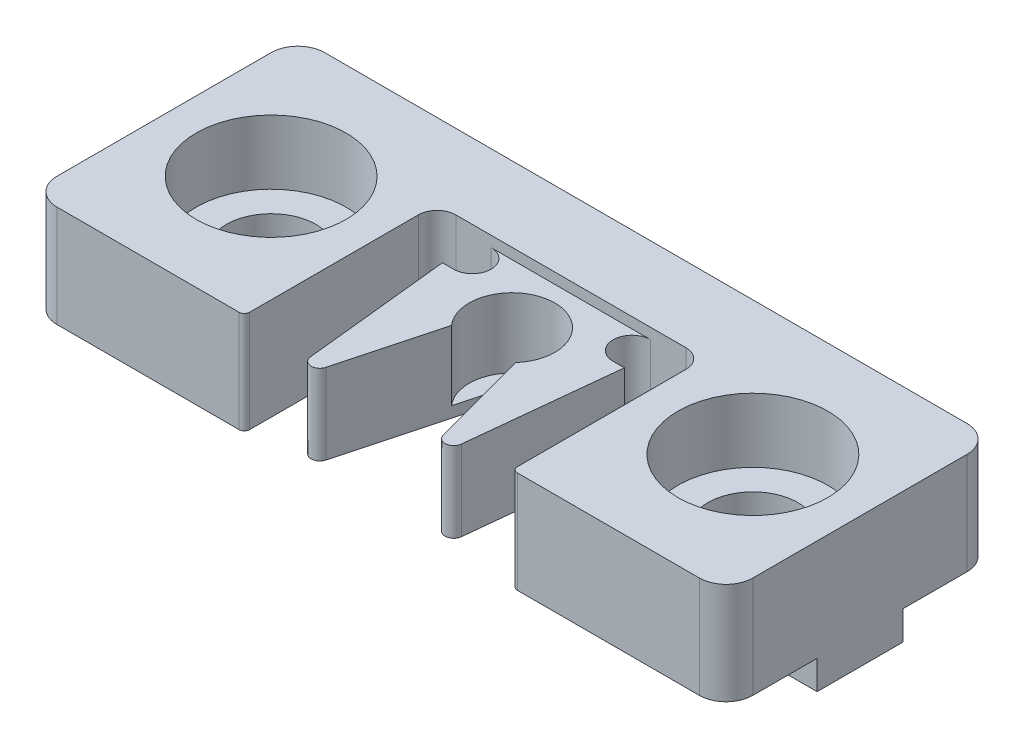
ISO-10303-21;
HEADER;
FILE_DESCRIPTION(('STEP AP214'),'2;1');
FILE_NAME('part.step','',(''),(''),'','','');
FILE_SCHEMA(('AUTOMOTIVE_DESIGN { 1 0 10303 214 1 1 1 1 }'));
ENDSEC;
DATA;
#1=APPLICATION_CONTEXT('core data for automotive mechanical design processes');
#2=APPLICATION_PROTOCOL_DEFINITION('international standard','automotive_design',2000,#1);
#3=PRODUCT_CONTEXT('',#1,'mechanical');
#4=PRODUCT('Part','Part','',(#3));
#5=PRODUCT_RELATED_PRODUCT_CATEGORY('part','',(#4));
#6=PRODUCT_DEFINITION_FORMATION('','',#4);
#7=PRODUCT_DEFINITION_CONTEXT('part definition',#1,'design');
#8=PRODUCT_DEFINITION('design','',#6,#7);
#9=PRODUCT_DEFINITION_SHAPE('','',#8);
#10=(LENGTH_UNIT() NAMED_UNIT(*) SI_UNIT(.MILLI.,.METRE.));
#11=(NAMED_UNIT(*) PLANE_ANGLE_UNIT() SI_UNIT($,.RADIAN.));
#12=(NAMED_UNIT(*) SI_UNIT($,.STERADIAN.) SOLID_ANGLE_UNIT());
#13=UNCERTAINTY_MEASURE_WITH_UNIT(LENGTH_MEASURE(1.E-05),#10,'distance_accuracy_value','');
#14=(GEOMETRIC_REPRESENTATION_CONTEXT(3) GLOBAL_UNCERTAINTY_ASSIGNED_CONTEXT((#13)) GLOBAL_UNIT_ASSIGNED_CONTEXT((#10,
#11,#12)) REPRESENTATION_CONTEXT('',''));
#15=CARTESIAN_POINT('',(0.,0.,0.));
#16=DIRECTION('',(0.,0.,1.));
#17=DIRECTION('',(1.,0.,0.));
#18=AXIS2_PLACEMENT_3D('',#15,#16,#17);
#19=CARTESIAN_POINT('',(-2.00025,2.,0.));
#20=DIRECTION('',(0.,-1.,0.));
#21=DIRECTION('',(0.,0.,-1.));
#22=AXIS2_PLACEMENT_3D('',#19,#20,#21);
#23=PLANE('',#22);
#24=CARTESIAN_POINT('',(0.,2.,0.));
#25=DIRECTION('',(0.,1.,0.));
#26=DIRECTION('',(0.,0.,1.));
#27=AXIS2_PLACEMENT_3D('',#24,#25,#26);
#28=CIRCLE('',#27,4.0005);
#29=CARTESIAN_POINT('',(3.00015340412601,2.,2.64633327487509));
#30=VERTEX_POINT('',#29);
#31=CARTESIAN_POINT('',(1.27503159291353,2.,-3.7918721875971));
#32=VERTEX_POINT('',#31);
#33=EDGE_CURVE('E19',#30,#32,#28,.T.);
#34=ORIENTED_EDGE('',*,*,#33,.T.);
#35=DIRECTION('',(0.25882042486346,0.,0.965925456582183));
#36=VECTOR('',#35,1.);
#37=CARTESIAN_POINT('',(5.48157619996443,2.,11.907076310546));
#38=LINE('',#37,#36);
#39=EDGE_CURVE('E262',#30,#32,#38,.F.);
#40=ORIENTED_EDGE('',*,*,#39,.F.);
#41=EDGE_LOOP('',(#34,#40));
#42=FACE_BOUND('',#41,.T.);
#43=ADVANCED_FACE('F16',(#42),#23,.F.);
#44=CARTESIAN_POINT('',(-2.00025,2.,0.));
#45=DIRECTION('',(0.,-1.,0.));
#46=DIRECTION('',(0.,0.,-1.));
#47=AXIS2_PLACEMENT_3D('',#44,#45,#46);
#48=PLANE('',#47);
#49=CARTESIAN_POINT('',(0.,2.,0.));
#50=DIRECTION('',(0.,1.,0.));
#51=DIRECTION('',(0.,0.,1.));
#52=AXIS2_PLACEMENT_3D('',#49,#50,#51);
#53=CIRCLE('',#52,4.0005);
#54=CARTESIAN_POINT('',(-1.27503419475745,2.,-3.79187131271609));
#55=VERTEX_POINT('',#54);
#56=CARTESIAN_POINT('',(-3.0001483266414,2.,2.64633903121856));
#57=VERTEX_POINT('',#56);
#58=EDGE_CURVE('E264',#55,#57,#53,.T.);
#59=ORIENTED_EDGE('',*,*,#58,.T.);
#60=DIRECTION('',(0.25881916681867,0.,-0.965925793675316));
#61=VECTOR('',#60,1.);
#62=CARTESIAN_POINT('',(-2.99999721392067,2.,2.64577507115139));
#63=LINE('',#62,#61);
#64=EDGE_CURVE('E282',#55,#57,#63,.F.);
#65=ORIENTED_EDGE('',*,*,#64,.F.);
#66=EDGE_LOOP('',(#59,#65));
#67=FACE_BOUND('',#66,.T.);
#68=ADVANCED_FACE('F461',(#67),#48,.F.);
#69=CARTESIAN_POINT('',(0.,5.75,0.));
#70=DIRECTION('',(0.,1.,0.));
#71=DIRECTION('',(0.,0.,1.));
#72=AXIS2_PLACEMENT_3D('',#69,#70,#71);
#73=CYLINDRICAL_SURFACE('',#72,4.0005);
#74=DIRECTION('',(0.,1.,0.));
#75=VECTOR('',#74,1.);
#76=CARTESIAN_POINT('',(-3.0001483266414,0.,2.64633903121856));
#77=LINE('',#76,#75);
#78=CARTESIAN_POINT('',(-3.0001483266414,8.5,2.64633903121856));
#79=VERTEX_POINT('',#78);
#80=EDGE_CURVE('E465',#57,#79,#77,.T.);
#81=ORIENTED_EDGE('',*,*,#80,.F.);
#82=ORIENTED_EDGE('',*,*,#58,.F.);
#83=DIRECTION('',(0.,1.,0.));
#84=VECTOR('',#83,1.);
#85=CARTESIAN_POINT('',(-1.27503419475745,0.,-3.79187131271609));
#86=LINE('',#85,#84);
#87=CARTESIAN_POINT('',(-1.27503419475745,1.,-3.79187131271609));
#88=VERTEX_POINT('',#87);
#89=EDGE_CURVE('E472',#88,#55,#86,.T.);
#90=ORIENTED_EDGE('',*,*,#89,.F.);
#91=CARTESIAN_POINT('',(0.,1.,0.));
#92=DIRECTION('',(0.,1.,0.));
#93=DIRECTION('',(0.,0.,1.));
#94=AXIS2_PLACEMENT_3D('',#91,#92,#93);
#95=CIRCLE('',#94,4.0005);
#96=CARTESIAN_POINT('',(1.27503159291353,1.,-3.7918721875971));
#97=VERTEX_POINT('',#96);
#98=EDGE_CURVE('E270',#88,#97,#95,.F.);
#99=ORIENTED_EDGE('',*,*,#98,.T.);
#100=DIRECTION('',(0.,1.,0.));
#101=VECTOR('',#100,1.);
#102=CARTESIAN_POINT('',(1.27503159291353,0.,-3.7918721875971));
#103=LINE('',#102,#101);
#104=EDGE_CURVE('E266',#32,#97,#103,.F.);
#105=ORIENTED_EDGE('',*,*,#104,.F.);
#106=ORIENTED_EDGE('',*,*,#33,.F.);
#107=DIRECTION('',(0.,1.,0.));
#108=VECTOR('',#107,1.);
#109=CARTESIAN_POINT('',(3.00015340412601,0.,2.64633327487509));
#110=LINE('',#109,#108);
#111=CARTESIAN_POINT('',(3.00015340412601,8.5,2.64633327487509));
#112=VERTEX_POINT('',#111);
#113=EDGE_CURVE('E278',#112,#30,#110,.F.);
#114=ORIENTED_EDGE('',*,*,#113,.F.);
#115=CARTESIAN_POINT('',(0.,8.5,0.));
#116=DIRECTION('',(0.,1.,0.));
#117=DIRECTION('',(0.,0.,1.));
#118=AXIS2_PLACEMENT_3D('',#115,#116,#117);
#119=CIRCLE('',#118,4.0005);
#120=EDGE_CURVE('E452',#79,#112,#119,.F.);
#121=ORIENTED_EDGE('',*,*,#120,.F.);
#122=EDGE_LOOP('',(#81,#82,#90,#99,#105,#106,#114,#121));
#123=FACE_BOUND('',#122,.T.);
#124=ADVANCED_FACE('F268',(#123),#73,.F.);
#125=CARTESIAN_POINT('',(5.48157619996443,0.,11.907076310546));
#126=DIRECTION('',(-0.965925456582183,0.,0.25882042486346));
#127=DIRECTION('',(0.25882042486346,0.,0.965925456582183));
#128=AXIS2_PLACEMENT_3D('',#125,#126,#127);
#129=PLANE('',#128);
#130=DIRECTION('',(0.25882042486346,0.,0.965925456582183));
#131=VECTOR('',#130,1.);
#132=CARTESIAN_POINT('',(1.27503159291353,1.,-3.7918721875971));
#133=LINE('',#132,#131);
#134=CARTESIAN_POINT('',(5.48157675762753,1.,11.9070783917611));
#135=VERTEX_POINT('',#134);
#136=EDGE_CURVE('E442',#97,#135,#133,.T.);
#137=ORIENTED_EDGE('',*,*,#136,.T.);
#138=DIRECTION('',(0.,1.,0.));
#139=VECTOR('',#138,1.);
#140=CARTESIAN_POINT('',(5.48157619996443,0.,11.907076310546));
#141=LINE('',#140,#139);
#142=CARTESIAN_POINT('',(5.48157675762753,8.5,11.9070783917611));
#143=VERTEX_POINT('',#142);
#144=EDGE_CURVE('E274',#143,#135,#141,.F.);
#145=ORIENTED_EDGE('',*,*,#144,.F.);
#146=DIRECTION('',(0.25882042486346,0.,0.965925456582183));
#147=VECTOR('',#146,1.);
#148=CARTESIAN_POINT('',(3.00015340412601,8.5,2.64633327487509));
#149=LINE('',#148,#147);
#150=EDGE_CURVE('E451',#112,#143,#149,.T.);
#151=ORIENTED_EDGE('',*,*,#150,.F.);
#152=ORIENTED_EDGE('',*,*,#113,.T.);
#153=ORIENTED_EDGE('',*,*,#39,.T.);
#154=ORIENTED_EDGE('',*,*,#104,.T.);
#155=EDGE_LOOP('',(#137,#145,#151,#152,#153,#154));
#156=FACE_BOUND('',#155,.T.);
#157=ADVANCED_FACE('F276',(#156),#129,.T.);
#158=CARTESIAN_POINT('',(6.2543142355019,0.,11.7000250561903));
#159=DIRECTION('',(0.,1.,0.));
#160=DIRECTION('',(-1.,0.,0.));
#161=AXIS2_PLACEMENT_3D('',#158,#159,#160);
#162=CYLINDRICAL_SURFACE('',#161,0.799996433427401);
#163=CARTESIAN_POINT('',(6.2543142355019,1.,11.7000250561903));
#164=DIRECTION('',(0.,1.,0.));
#165=DIRECTION('',(-1.,0.,0.));
#166=AXIS2_PLACEMENT_3D('',#163,#164,#165);
#167=CIRCLE('',#166,0.799996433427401);
#168=CARTESIAN_POINT('',(7.04992015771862,1.,11.7837239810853));
#169=VERTEX_POINT('',#168);
#170=EDGE_CURVE('E438',#135,#169,#167,.T.);
#171=ORIENTED_EDGE('',*,*,#170,.T.);
#172=DIRECTION('',(0.,1.,0.));
#173=VECTOR('',#172,1.);
#174=CARTESIAN_POINT('',(7.04992023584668,0.,11.7837232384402));
#175=LINE('',#174,#173);
#176=CARTESIAN_POINT('',(7.04992015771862,8.5,11.7837239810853));
#177=VERTEX_POINT('',#176);
#178=EDGE_CURVE('E487',#177,#169,#175,.F.);
#179=ORIENTED_EDGE('',*,*,#178,.F.);
#180=CARTESIAN_POINT('',(6.2543142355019,8.5,11.7000250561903));
#181=DIRECTION('',(0.,1.,0.));
#182=DIRECTION('',(-1.,0.,0.));
#183=AXIS2_PLACEMENT_3D('',#180,#181,#182);
#184=CIRCLE('',#183,0.799996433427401);
#185=EDGE_CURVE('E447',#143,#177,#184,.T.);
#186=ORIENTED_EDGE('',*,*,#185,.F.);
#187=ORIENTED_EDGE('',*,*,#144,.T.);
#188=EDGE_LOOP('',(#171,#179,#186,#187));
#189=FACE_BOUND('',#188,.T.);
#190=ADVANCED_FACE('F491',(#189),#162,.T.);
#191=CARTESIAN_POINT('',(8.49999976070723,0.,-1.99998437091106));
#192=DIRECTION('',(0.994511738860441,0.,0.104625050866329));
#193=DIRECTION('',(0.104625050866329,0.,-0.994511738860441));
#194=AXIS2_PLACEMENT_3D('',#191,#192,#193);
#195=PLANE('',#194);
#196=DIRECTION('',(0.104625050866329,0.,-0.994511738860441));
#197=VECTOR('',#196,1.);
#198=CARTESIAN_POINT('',(7.04992023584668,1.,11.7837232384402));
#199=LINE('',#198,#197);
#200=CARTESIAN_POINT('',(8.49999976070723,1.,-1.99998437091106));
#201=VERTEX_POINT('',#200);
#202=EDGE_CURVE('E441',#169,#201,#199,.T.);
#203=ORIENTED_EDGE('',*,*,#202,.T.);
#204=DIRECTION('',(0.,1.,0.));
#205=VECTOR('',#204,1.);
#206=CARTESIAN_POINT('',(8.49999976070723,0.,-1.99998437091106));
#207=LINE('',#206,#205);
#208=CARTESIAN_POINT('',(8.49999976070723,8.5,-1.99998437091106));
#209=VERTEX_POINT('',#208);
#210=EDGE_CURVE('E480',#209,#201,#207,.F.);
#211=ORIENTED_EDGE('',*,*,#210,.F.);
#212=DIRECTION('',(0.104625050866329,0.,-0.994511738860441));
#213=VECTOR('',#212,1.);
#214=CARTESIAN_POINT('',(7.04992023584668,8.5,11.7837232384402));
#215=LINE('',#214,#213);
#216=EDGE_CURVE('E450',#177,#209,#215,.T.);
#217=ORIENTED_EDGE('',*,*,#216,.F.);
#218=ORIENTED_EDGE('',*,*,#178,.T.);
#219=EDGE_LOOP('',(#203,#211,#217,#218));
#220=FACE_BOUND('',#219,.T.);
#221=ADVANCED_FACE('F571',(#220),#195,.T.);
#222=CARTESIAN_POINT('',(7.44999670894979,0.,-1.99998368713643));
#223=DIRECTION('',(-6.51212038E-07,0.,-0.999999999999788));
#224=DIRECTION('',(-0.999999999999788,0.,6.51212038E-07));
#225=AXIS2_PLACEMENT_3D('',#222,#223,#224);
#226=PLANE('',#225);
#227=DIRECTION('',(1.,0.,0.));
#228=VECTOR('',#227,1.);
#229=CARTESIAN_POINT('',(5.907925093E-06,1.,-1.99998437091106));
#230=LINE('',#229,#228);
#231=CARTESIAN_POINT('',(7.44999613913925,1.,-1.99998402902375));
#232=VERTEX_POINT('',#231);
#233=EDGE_CURVE('E437',#201,#232,#230,.F.);
#234=ORIENTED_EDGE('',*,*,#233,.T.);
#235=DIRECTION('',(0.,1.,0.));
#236=VECTOR('',#235,1.);
#237=CARTESIAN_POINT('',(7.44999670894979,0.,-1.99998368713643));
#238=LINE('',#237,#236);
#239=CARTESIAN_POINT('',(7.44999613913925,8.5,-1.99998402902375));
#240=VERTEX_POINT('',#239);
#241=EDGE_CURVE('E446',#232,#240,#238,.T.);
#242=ORIENTED_EDGE('',*,*,#241,.T.);
#243=DIRECTION('',(1.,0.,0.));
#244=VECTOR('',#243,1.);
#245=CARTESIAN_POINT('',(5.907925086E-06,8.5,-1.99998437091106));
#246=LINE('',#245,#244);
#247=EDGE_CURVE('E485',#209,#240,#246,.F.);
#248=ORIENTED_EDGE('',*,*,#247,.F.);
#249=ORIENTED_EDGE('',*,*,#210,.T.);
#250=EDGE_LOOP('',(#234,#242,#248,#249));
#251=FACE_BOUND('',#250,.T.);
#252=ADVANCED_FACE('F569',(#251),#226,.T.);
#253=CARTESIAN_POINT('',(-7.04990657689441,0.,11.7837324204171));
#254=DIRECTION('',(-0.994511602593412,0.,0.104626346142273));
#255=DIRECTION('',(0.104626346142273,0.,0.994511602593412));
#256=AXIS2_PLACEMENT_3D('',#253,#254,#255);
#257=PLANE('',#256);
#258=DIRECTION('',(0.104626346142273,0.,0.994511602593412));
#259=VECTOR('',#258,1.);
#260=CARTESIAN_POINT('',(-8.50000405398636,1.,-1.9999733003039));
#261=LINE('',#260,#259);
#262=CARTESIAN_POINT('',(-8.50000410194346,1.,-1.99997375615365));
#263=VERTEX_POINT('',#262);
#264=CARTESIAN_POINT('',(-7.04990659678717,1.,11.7837322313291));
#265=VERTEX_POINT('',#264);
#266=EDGE_CURVE('E433',#263,#265,#261,.T.);
#267=ORIENTED_EDGE('',*,*,#266,.T.);
#268=DIRECTION('',(0.,1.,0.));
#269=VECTOR('',#268,1.);
#270=CARTESIAN_POINT('',(-7.04990657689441,0.,11.7837324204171));
#271=LINE('',#270,#269);
#272=CARTESIAN_POINT('',(-7.04990659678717,8.5,11.7837322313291));
#273=VERTEX_POINT('',#272);
#274=EDGE_CURVE('E475',#273,#265,#271,.F.);
#275=ORIENTED_EDGE('',*,*,#274,.F.);
#276=DIRECTION('',(0.104626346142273,0.,0.994511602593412));
#277=VECTOR('',#276,1.);
#278=CARTESIAN_POINT('',(-8.50000405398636,8.5,-1.9999733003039));
#279=LINE('',#278,#277);
#280=CARTESIAN_POINT('',(-8.50000410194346,8.5,-1.99997375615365));
#281=VERTEX_POINT('',#280);
#282=EDGE_CURVE('E458',#281,#273,#279,.T.);
#283=ORIENTED_EDGE('',*,*,#282,.F.);
#284=DIRECTION('',(0.,1.,0.));
#285=VECTOR('',#284,1.);
#286=CARTESIAN_POINT('',(-8.50000405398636,0.,-1.9999733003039));
#287=LINE('',#286,#285);
#288=EDGE_CURVE('E469',#263,#281,#287,.T.);
#289=ORIENTED_EDGE('',*,*,#288,.F.);
#290=EDGE_LOOP('',(#267,#275,#283,#289));
#291=FACE_BOUND('',#290,.T.);
#292=ADVANCED_FACE('F551',(#291),#257,.T.);
#293=CARTESIAN_POINT('',(-6.25429864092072,0.,11.7000311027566));
#294=DIRECTION('',(0.,1.,0.));
#295=DIRECTION('',(-1.,0.,0.));
#296=AXIS2_PLACEMENT_3D('',#293,#294,#295);
#297=CYLINDRICAL_SURFACE('',#296,0.799998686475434);
#298=CARTESIAN_POINT('',(-6.25429864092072,1.,11.7000311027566));
#299=DIRECTION('',(0.,1.,0.));
#300=DIRECTION('',(-1.,0.,0.));
#301=AXIS2_PLACEMENT_3D('',#298,#299,#300);
#302=CIRCLE('',#301,0.799998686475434);
#303=CARTESIAN_POINT('',(-5.48155892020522,1.,11.9070847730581));
#304=VERTEX_POINT('',#303);
#305=EDGE_CURVE('E429',#265,#304,#302,.T.);
#306=ORIENTED_EDGE('',*,*,#305,.T.);
#307=DIRECTION('',(0.,1.,0.));
#308=VECTOR('',#307,1.);
#309=CARTESIAN_POINT('',(-5.48155856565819,0.,11.9070834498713));
#310=LINE('',#309,#308);
#311=CARTESIAN_POINT('',(-5.48155892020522,8.5,11.9070847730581));
#312=VERTEX_POINT('',#311);
#313=EDGE_CURVE('E473',#312,#304,#310,.F.);
#314=ORIENTED_EDGE('',*,*,#313,.F.);
#315=CARTESIAN_POINT('',(-6.25429864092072,8.5,11.7000311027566));
#316=DIRECTION('',(0.,1.,0.));
#317=DIRECTION('',(-1.,0.,0.));
#318=AXIS2_PLACEMENT_3D('',#315,#316,#317);
#319=CIRCLE('',#318,0.799998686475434);
#320=EDGE_CURVE('E456',#273,#312,#319,.T.);
#321=ORIENTED_EDGE('',*,*,#320,.F.);
#322=ORIENTED_EDGE('',*,*,#274,.T.);
#323=EDGE_LOOP('',(#306,#314,#321,#322));
#324=FACE_BOUND('',#323,.T.);
#325=ADVANCED_FACE('F573',(#324),#297,.T.);
#326=CARTESIAN_POINT('',(-2.99999721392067,0.,2.64577507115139));
#327=DIRECTION('',(0.965925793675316,0.,0.25881916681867));
#328=DIRECTION('',(0.25881916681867,0.,-0.965925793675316));
#329=AXIS2_PLACEMENT_3D('',#326,#327,#328);
#330=PLANE('',#329);
#331=ORIENTED_EDGE('',*,*,#64,.T.);
#332=ORIENTED_EDGE('',*,*,#80,.T.);
#333=DIRECTION('',(0.25881916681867,0.,-0.965925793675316));
#334=VECTOR('',#333,1.);
#335=CARTESIAN_POINT('',(-5.48155856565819,8.5,11.9070834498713));
#336=LINE('',#335,#334);
#337=EDGE_CURVE('E455',#312,#79,#336,.T.);
#338=ORIENTED_EDGE('',*,*,#337,.F.);
#339=ORIENTED_EDGE('',*,*,#313,.T.);
#340=DIRECTION('',(0.25881916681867,0.,-0.965925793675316));
#341=VECTOR('',#340,1.);
#342=CARTESIAN_POINT('',(-5.48155856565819,1.,11.9070834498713));
#343=LINE('',#342,#341);
#344=EDGE_CURVE('E432',#304,#88,#343,.T.);
#345=ORIENTED_EDGE('',*,*,#344,.T.);
#346=ORIENTED_EDGE('',*,*,#89,.T.);
#347=EDGE_LOOP('',(#331,#332,#338,#339,#345,#346));
#348=FACE_BOUND('',#347,.T.);
#349=ADVANCED_FACE('F470',(#348),#330,.T.);
#350=CARTESIAN_POINT('',(-8.50000405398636,0.,-1.9999733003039));
#351=DIRECTION('',(-6.51212038E-07,0.,-0.999999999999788));
#352=DIRECTION('',(-0.999999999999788,0.,6.51212038E-07));
#353=AXIS2_PLACEMENT_3D('',#350,#351,#352);
#354=PLANE('',#353);
#355=DIRECTION('',(1.,0.,0.));
#356=VECTOR('',#355,1.);
#357=CARTESIAN_POINT('',(5.907925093E-06,1.,-1.99997398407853));
#358=LINE('',#357,#356);
#359=CARTESIAN_POINT('',(-7.45000157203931,1.,-1.99997398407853));
#360=VERTEX_POINT('',#359);
#361=EDGE_CURVE('E436',#360,#263,#358,.F.);
#362=ORIENTED_EDGE('',*,*,#361,.T.);
#363=ORIENTED_EDGE('',*,*,#288,.T.);
#364=DIRECTION('',(1.,0.,0.));
#365=VECTOR('',#364,1.);
#366=CARTESIAN_POINT('',(5.907925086E-06,8.5,-1.99997398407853));
#367=LINE('',#366,#365);
#368=CARTESIAN_POINT('',(-7.45000157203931,8.5,-1.99997398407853));
#369=VERTEX_POINT('',#368);
#370=EDGE_CURVE('E482',#369,#281,#367,.F.);
#371=ORIENTED_EDGE('',*,*,#370,.F.);
#372=DIRECTION('',(0.,1.,0.));
#373=VECTOR('',#372,1.);
#374=CARTESIAN_POINT('',(-7.45000100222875,0.,-1.99997398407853));
#375=LINE('',#374,#373);
#376=EDGE_CURVE('E428',#369,#360,#375,.F.);
#377=ORIENTED_EDGE('',*,*,#376,.T.);
#378=EDGE_LOOP('',(#362,#363,#371,#377));
#379=FACE_BOUND('',#378,.T.);
#380=ADVANCED_FACE('F548',(#379),#354,.T.);
#381=CARTESIAN_POINT('',(-22.5,6.50000000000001,0.));
#382=DIRECTION('',(0.,1.,0.));
#383=DIRECTION('',(0.,0.,1.));
#384=AXIS2_PLACEMENT_3D('',#381,#382,#383);
#385=CYLINDRICAL_SURFACE('',#384,7.);
#386=CARTESIAN_POINT('',(-22.5,3.50000000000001,0.));
#387=DIRECTION('',(0.,1.,0.));
#388=DIRECTION('',(0.,0.,1.));
#389=AXIS2_PLACEMENT_3D('',#386,#387,#388);
#390=CIRCLE('',#389,7.);
#391=CARTESIAN_POINT('',(-22.5,3.50000000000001,7.));
#392=VERTEX_POINT('',#391);
#393=EDGE_CURVE('E414',#392,#392,#390,.F.);
#394=ORIENTED_EDGE('',*,*,#393,.T.);
#395=EDGE_LOOP('',(#394));
#396=FACE_BOUND('',#395,.T.);
#397=CARTESIAN_POINT('',(-22.5,9.50000000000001,0.));
#398=DIRECTION('',(0.,1.,0.));
#399=DIRECTION('',(0.,0.,1.));
#400=AXIS2_PLACEMENT_3D('',#397,#398,#399);
#401=CIRCLE('',#400,7.);
#402=CARTESIAN_POINT('',(-22.5,9.50000000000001,7.));
#403=VERTEX_POINT('',#402);
#404=EDGE_CURVE('E420',#403,#403,#401,.F.);
#405=ORIENTED_EDGE('',*,*,#404,.F.);
#406=EDGE_LOOP('',(#405));
#407=FACE_BOUND('',#406,.T.);
#408=ADVANCED_FACE('F631',(#396,#407),#385,.F.);
#409=CARTESIAN_POINT('',(22.5,6.5,0.));
#410=DIRECTION('',(0.,1.,0.));
#411=DIRECTION('',(0.,0.,1.));
#412=AXIS2_PLACEMENT_3D('',#409,#410,#411);
#413=CYLINDRICAL_SURFACE('',#412,7.);
#414=CARTESIAN_POINT('',(22.5,3.5,0.));
#415=DIRECTION('',(0.,1.,0.));
#416=DIRECTION('',(0.,0.,1.));
#417=AXIS2_PLACEMENT_3D('',#414,#415,#416);
#418=CIRCLE('',#417,7.);
#419=CARTESIAN_POINT('',(22.5,3.5,7.));
#420=VERTEX_POINT('',#419);
#421=EDGE_CURVE('E411',#420,#420,#418,.F.);
#422=ORIENTED_EDGE('',*,*,#421,.T.);
#423=EDGE_LOOP('',(#422));
#424=FACE_BOUND('',#423,.T.);
#425=CARTESIAN_POINT('',(22.5,9.5,0.));
#426=DIRECTION('',(0.,1.,0.));
#427=DIRECTION('',(0.,0.,1.));
#428=AXIS2_PLACEMENT_3D('',#425,#426,#427);
#429=CIRCLE('',#428,7.);
#430=CARTESIAN_POINT('',(22.5,9.5,7.));
#431=VERTEX_POINT('',#430);
#432=EDGE_CURVE('E417',#431,#431,#429,.F.);
#433=ORIENTED_EDGE('',*,*,#432,.F.);
#434=EDGE_LOOP('',(#433));
#435=FACE_BOUND('',#434,.T.);
#436=ADVANCED_FACE('F639',(#424,#435),#413,.F.);
#437=CARTESIAN_POINT('',(-30.0000000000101,-2.69999999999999,4.884090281E-06));
#438=DIRECTION('',(0.,1.,0.));
#439=DIRECTION('',(0.,0.,1.));
#440=AXIS2_PLACEMENT_3D('',#437,#438,#439);
#441=PLANE('',#440);
#442=DIRECTION('',(-0.999999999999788,0.,6.51212037E-07));
#443=VECTOR('',#442,1.);
#444=CARTESIAN_POINT('',(-30.0000026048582,-2.69999999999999,-3.99999511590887));
#445=LINE('',#444,#443);
#446=CARTESIAN_POINT('',(-27.5000026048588,-2.69999999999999,-3.99999674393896));
#447=VERTEX_POINT('',#446);
#448=CARTESIAN_POINT('',(-32.5000026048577,-2.69999999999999,-3.99999348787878));
#449=VERTEX_POINT('',#448);
#450=EDGE_CURVE('E395',#447,#449,#445,.T.);
#451=ORIENTED_EDGE('',*,*,#450,.F.);
#452=DIRECTION('',(-6.51212037E-07,0.,-0.999999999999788));
#453=VECTOR('',#452,1.);
#454=CARTESIAN_POINT('',(-27.5000000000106,-2.69999999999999,3.2560601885E-06));
#455=LINE('',#454,#453);
#456=CARTESIAN_POINT('',(-27.4999973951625,-2.69999999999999,4.00000325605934));
#457=VERTEX_POINT('',#456);
#458=EDGE_CURVE('E392',#457,#447,#455,.T.);
#459=ORIENTED_EDGE('',*,*,#458,.F.);
#460=DIRECTION('',(0.999999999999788,0.,-6.51212037E-07));
#461=VECTOR('',#460,1.);
#462=CARTESIAN_POINT('',(-29.9999973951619,-2.69999999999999,4.00000488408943));
#463=LINE('',#462,#461);
#464=CARTESIAN_POINT('',(-32.4999973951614,-2.69999999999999,4.00000651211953));
#465=VERTEX_POINT('',#464);
#466=EDGE_CURVE('E387',#465,#457,#463,.T.);
#467=ORIENTED_EDGE('',*,*,#466,.F.);
#468=DIRECTION('',(6.51212037E-07,0.,0.999999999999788));
#469=VECTOR('',#468,1.);
#470=CARTESIAN_POINT('',(-32.5000000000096,-2.69999999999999,6.5121203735E-06));
#471=LINE('',#470,#469);
#472=EDGE_CURVE('E383',#449,#465,#471,.T.);
#473=ORIENTED_EDGE('',*,*,#472,.F.);
#474=EDGE_LOOP('',(#451,#459,#467,#473));
#475=FACE_BOUND('',#474,.T.);
#476=ADVANCED_FACE('F648',(#475),#441,.F.);
#477=CARTESIAN_POINT('',(5.907925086E-06,8.5,6.34357662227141));
#478=DIRECTION('',(0.,1.,0.));
#479=DIRECTION('',(0.,0.,1.));
#480=AXIS2_PLACEMENT_3D('',#477,#478,#479);
#481=PLANE('',#480);
#482=CARTESIAN_POINT('',(7.44999556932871,8.5,-3.74998368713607));
#483=DIRECTION('',(0.,1.,0.));
#484=DIRECTION('',(-1.,0.,0.));
#485=AXIS2_PLACEMENT_3D('',#482,#483,#484);
#486=CIRCLE('',#485,1.75000000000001);
#487=CARTESIAN_POINT('',(7.44999442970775,8.5,-5.49998368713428));
#488=VERTEX_POINT('',#487);
#489=EDGE_CURVE('E444',#240,#488,#486,.F.);
#490=ORIENTED_EDGE('',*,*,#489,.T.);
#491=DIRECTION('',(0.999999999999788,0.,-6.51211941E-07));
#492=VECTOR('',#491,1.);
#493=CARTESIAN_POINT('',(-1.80473965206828E-06,8.5,-5.49997883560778));
#494=LINE('',#493,#492);
#495=CARTESIAN_POINT('',(-7.45000328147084,8.5,-5.49997398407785));
#496=VERTEX_POINT('',#495);
#497=EDGE_CURVE('E364',#496,#488,#494,.T.);
#498=ORIENTED_EDGE('',*,*,#497,.F.);
#499=CARTESIAN_POINT('',(-7.45000214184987,8.5,-3.74997398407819));
#500=DIRECTION('',(0.,1.,0.));
#501=DIRECTION('',(-1.,0.,0.));
#502=AXIS2_PLACEMENT_3D('',#499,#500,#501);
#503=CIRCLE('',#502,1.75000000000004);
#504=EDGE_CURVE('E423',#496,#369,#503,.F.);
#505=ORIENTED_EDGE('',*,*,#504,.T.);
#506=ORIENTED_EDGE('',*,*,#370,.T.);
#507=ORIENTED_EDGE('',*,*,#282,.T.);
#508=ORIENTED_EDGE('',*,*,#320,.T.);
#509=ORIENTED_EDGE('',*,*,#337,.T.);
#510=ORIENTED_EDGE('',*,*,#120,.T.);
#511=ORIENTED_EDGE('',*,*,#150,.T.);
#512=ORIENTED_EDGE('',*,*,#185,.T.);
#513=ORIENTED_EDGE('',*,*,#216,.T.);
#514=ORIENTED_EDGE('',*,*,#247,.T.);
#515=EDGE_LOOP('',(#490,#498,#505,#506,#507,#508,#509,#510,#511,#512,#513,#514));
#516=FACE_BOUND('',#515,.T.);
#517=ADVANCED_FACE('F554',(#516),#481,.T.);
#518=CARTESIAN_POINT('',(7.44999556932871,0.,-3.74998368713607));
#519=DIRECTION('',(0.,1.,0.));
#520=DIRECTION('',(-1.,0.,0.));
#521=AXIS2_PLACEMENT_3D('',#518,#519,#520);
#522=CYLINDRICAL_SURFACE('',#521,1.75000000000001);
#523=ORIENTED_EDGE('',*,*,#241,.F.);
#524=CARTESIAN_POINT('',(7.44999556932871,1.,-3.74998368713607));
#525=DIRECTION('',(0.,1.,0.));
#526=DIRECTION('',(-1.,0.,0.));
#527=AXIS2_PLACEMENT_3D('',#524,#525,#526);
#528=CIRCLE('',#527,1.75000000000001);
#529=CARTESIAN_POINT('',(7.44999442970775,1.,-5.49998368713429));
#530=VERTEX_POINT('',#529);
#531=EDGE_CURVE('E434',#232,#530,#528,.F.);
#532=ORIENTED_EDGE('',*,*,#531,.T.);
#533=DIRECTION('',(0.,1.,0.));
#534=VECTOR('',#533,1.);
#535=CARTESIAN_POINT('',(7.44999442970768,0.,-5.49998368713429));
#536=LINE('',#535,#534);
#537=EDGE_CURVE('E367',#488,#530,#536,.F.);
#538=ORIENTED_EDGE('',*,*,#537,.F.);
#539=ORIENTED_EDGE('',*,*,#489,.F.);
#540=EDGE_LOOP('',(#523,#532,#538,#539));
#541=FACE_BOUND('',#540,.T.);
#542=ADVANCED_FACE('F566',(#541),#522,.F.);
#543=CARTESIAN_POINT('',(5.907925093E-06,1.,6.34357662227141));
#544=DIRECTION('',(0.,1.,0.));
#545=DIRECTION('',(0.,0.,1.));
#546=AXIS2_PLACEMENT_3D('',#543,#544,#545);
#547=PLANE('',#546);
#548=ORIENTED_EDGE('',*,*,#305,.F.);
#549=ORIENTED_EDGE('',*,*,#266,.F.);
#550=ORIENTED_EDGE('',*,*,#361,.F.);
#551=CARTESIAN_POINT('',(-7.45000214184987,1.00000000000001,-3.74997398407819));
#552=DIRECTION('',(0.,1.,0.));
#553=DIRECTION('',(-1.,0.,0.));
#554=AXIS2_PLACEMENT_3D('',#551,#552,#553);
#555=CIRCLE('',#554,1.75000000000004);
#556=CARTESIAN_POINT('',(-7.45000328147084,1.,-5.49997398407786));
#557=VERTEX_POINT('',#556);
#558=EDGE_CURVE('E426',#360,#557,#555,.T.);
#559=ORIENTED_EDGE('',*,*,#558,.T.);
#560=DIRECTION('',(0.999999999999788,0.,-6.51211941E-07));
#561=VECTOR('',#560,1.);
#562=CARTESIAN_POINT('',(-7.45000320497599,1.,-5.49997398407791));
#563=LINE('',#562,#561);
#564=EDGE_CURVE('E510',#530,#557,#563,.F.);
#565=ORIENTED_EDGE('',*,*,#564,.F.);
#566=ORIENTED_EDGE('',*,*,#531,.F.);
#567=ORIENTED_EDGE('',*,*,#233,.F.);
#568=ORIENTED_EDGE('',*,*,#202,.F.);
#569=ORIENTED_EDGE('',*,*,#170,.F.);
#570=ORIENTED_EDGE('',*,*,#136,.F.);
#571=ORIENTED_EDGE('',*,*,#98,.F.);
#572=ORIENTED_EDGE('',*,*,#344,.F.);
#573=EDGE_LOOP('',(#548,#549,#550,#559,#565,#566,#567,#568,#569,#570,#571,#572));
#574=FACE_BOUND('',#573,.T.);
#575=ADVANCED_FACE('F498',(#574),#547,.F.);
#576=CARTESIAN_POINT('',(-7.45000214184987,0.,-3.74997398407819));
#577=DIRECTION('',(0.,1.,0.));
#578=DIRECTION('',(-1.,0.,0.));
#579=AXIS2_PLACEMENT_3D('',#576,#577,#578);
#580=CYLINDRICAL_SURFACE('',#579,1.75000000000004);
#581=DIRECTION('',(0.,1.,0.));
#582=VECTOR('',#581,1.);
#583=CARTESIAN_POINT('',(-7.45000328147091,0.,-5.49997398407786));
#584=LINE('',#583,#582);
#585=EDGE_CURVE('E363',#557,#496,#584,.T.);
#586=ORIENTED_EDGE('',*,*,#585,.F.);
#587=ORIENTED_EDGE('',*,*,#558,.F.);
#588=ORIENTED_EDGE('',*,*,#376,.F.);
#589=ORIENTED_EDGE('',*,*,#504,.F.);
#590=EDGE_LOOP('',(#586,#587,#588,#589));
#591=FACE_BOUND('',#590,.T.);
#592=ADVANCED_FACE('F558',(#591),#580,.F.);
#593=CARTESIAN_POINT('',(-3.03608374E-07,9.5,0.258336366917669));
#594=DIRECTION('',(0.,1.,0.));
#595=DIRECTION('',(0.,0.,1.));
#596=AXIS2_PLACEMENT_3D('',#593,#594,#595);
#597=PLANE('',#596);
#598=ORIENTED_EDGE('',*,*,#432,.T.);
#599=EDGE_LOOP('',(#598));
#600=FACE_BOUND('',#599,.T.);
#601=ORIENTED_EDGE('',*,*,#404,.T.);
#602=EDGE_LOOP('',(#601));
#603=FACE_BOUND('',#602,.T.);
#604=DIRECTION('',(-6.51212038E-07,0.,-0.999999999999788));
#605=VECTOR('',#604,1.);
#606=CARTESIAN_POINT('',(-12.5000024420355,9.50000000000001,-3.74997069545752));
#607=LINE('',#606,#605);
#608=CARTESIAN_POINT('',(-12.5000024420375,9.50000000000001,-3.7499731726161));
#609=VERTEX_POINT('',#608);
#610=CARTESIAN_POINT('',(-12.499992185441,9.50000000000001,12.0000369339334));
#611=VERTEX_POINT('',#610);
#612=EDGE_CURVE('E372',#609,#611,#607,.F.);
#613=ORIENTED_EDGE('',*,*,#612,.F.);
#614=CARTESIAN_POINT('',(-10.7500043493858,9.50000000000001,-3.74997374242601));
#615=DIRECTION('',(0.,1.,0.));
#616=DIRECTION('',(-1.,0.,0.));
#617=AXIS2_PLACEMENT_3D('',#614,#615,#616);
#618=CIRCLE('',#617,1.74999809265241);
#619=CARTESIAN_POINT('',(-10.7500064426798,9.50000000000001,-5.49997183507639));
#620=VERTEX_POINT('',#619);
#621=EDGE_CURVE('E369',#609,#620,#618,.F.);
#622=ORIENTED_EDGE('',*,*,#621,.T.);
#623=DIRECTION('',(0.999999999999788,0.,-6.51211941E-07));
#624=VECTOR('',#623,1.);
#625=CARTESIAN_POINT('',(-7.45000320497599,9.5,-5.4999739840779));
#626=LINE('',#625,#624);
#627=CARTESIAN_POINT('',(10.7499974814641,9.5,-5.49998583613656));
#628=VERTEX_POINT('',#627);
#629=EDGE_CURVE('E544',#628,#620,#626,.F.);
#630=ORIENTED_EDGE('',*,*,#629,.F.);
#631=CARTESIAN_POINT('',(10.7499986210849,9.5,-3.7499858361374));
#632=DIRECTION('',(0.,1.,0.));
#633=DIRECTION('',(-1.,0.,0.));
#634=AXIS2_PLACEMENT_3D('',#631,#632,#633);
#635=CIRCLE('',#634,1.75000000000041);
#636=CARTESIAN_POINT('',(12.4999986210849,9.5,-3.74998697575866));
#637=VERTEX_POINT('',#636);
#638=EDGE_CURVE('E360',#628,#637,#635,.F.);
#639=ORIENTED_EDGE('',*,*,#638,.T.);
#640=DIRECTION('',(6.51212038E-07,0.,0.999999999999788));
#641=VECTOR('',#640,1.);
#642=CARTESIAN_POINT('',(12.5000088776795,9.5,12.0000206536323));
#643=LINE('',#642,#641);
#644=CARTESIAN_POINT('',(12.5000088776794,9.5,12.0000204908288));
#645=VERTEX_POINT('',#644);
#646=EDGE_CURVE('E983',#645,#637,#643,.F.);
#647=ORIENTED_EDGE('',*,*,#646,.F.);
#648=CARTESIAN_POINT('',(13.0000088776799,9.5,12.0000203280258));
#649=DIRECTION('',(0.,1.,0.));
#650=DIRECTION('',(-1.,0.,0.));
#651=AXIS2_PLACEMENT_3D('',#648,#649,#650);
#652=CIRCLE('',#651,0.500000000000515);
#653=CARTESIAN_POINT('',(13.0000092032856,9.5,12.5000203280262));
#654=VERTEX_POINT('',#653);
#655=EDGE_CURVE('E355',#654,#645,#652,.F.);
#656=ORIENTED_EDGE('',*,*,#655,.F.);
#657=DIRECTION('',(0.999999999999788,0.,-6.51212037E-07));
#658=VECTOR('',#657,1.);
#659=CARTESIAN_POINT('',(30.0000092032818,9.5,12.5000092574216));
#660=LINE('',#659,#658);
#661=CARTESIAN_POINT('',(30.0000092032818,9.5,12.5000092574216));
#662=VERTEX_POINT('',#661);
#663=EDGE_CURVE('E358',#662,#654,#660,.F.);
#664=ORIENTED_EDGE('',*,*,#663,.F.);
#665=CARTESIAN_POINT('',(29.9999945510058,9.5,9.99999623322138));
#666=DIRECTION('',(0.,1.,0.));
#667=DIRECTION('',(-1.,0.,0.));
#668=AXIS2_PLACEMENT_3D('',#665,#666,#667);
#669=CIRCLE('',#668,2.50001302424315);
#670=CARTESIAN_POINT('',(32.5000075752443,9.5,9.99999730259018));
#671=VERTEX_POINT('',#670);
#672=EDGE_CURVE('E350',#671,#662,#669,.F.);
#673=ORIENTED_EDGE('',*,*,#672,.F.);
#674=DIRECTION('',(-6.51212036E-07,0.,-0.999999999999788));
#675=VECTOR('',#674,1.);
#676=CARTESIAN_POINT('',(32.4999945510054,9.5,-9.99999999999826));
#677=LINE('',#676,#675);
#678=CARTESIAN_POINT('',(32.4999940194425,9.5,-9.99999999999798));
#679=VERTEX_POINT('',#678);
#680=EDGE_CURVE('E977',#679,#671,#677,.F.);
#681=ORIENTED_EDGE('',*,*,#680,.F.);
#682=CARTESIAN_POINT('',(29.99999348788,9.5,-9.99999837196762));
#683=DIRECTION('',(0.,1.,0.));
#684=DIRECTION('',(-1.,0.,0.));
#685=AXIS2_PLACEMENT_3D('',#682,#683,#684);
#686=CIRCLE('',#685,2.50000000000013);
#687=CARTESIAN_POINT('',(29.99999185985,9.5,-12.4999983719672));
#688=VERTEX_POINT('',#687);
#689=EDGE_CURVE('E402',#688,#679,#686,.F.);
#690=ORIENTED_EDGE('',*,*,#689,.F.);
#691=DIRECTION('',(-0.999999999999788,0.,6.51212037E-07));
#692=VECTOR('',#691,1.);
#693=CARTESIAN_POINT('',(-30.0000119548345,9.50000000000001,-12.4999592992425));
#694=LINE('',#693,#692);
#695=CARTESIAN_POINT('',(-30.0000110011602,9.50000000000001,-12.4999592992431));
#696=VERTEX_POINT('',#695);
#697=EDGE_CURVE('E404',#696,#688,#694,.F.);
#698=ORIENTED_EDGE('',*,*,#697,.F.);
#699=CARTESIAN_POINT('',(-30.000008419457,9.50000000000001,-9.99996120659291));
#700=DIRECTION('',(0.,1.,0.));
#701=DIRECTION('',(-1.,0.,0.));
#702=AXIS2_PLACEMENT_3D('',#699,#700,#701);
#703=CIRCLE('',#702,2.49999809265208);
#704=CARTESIAN_POINT('',(-32.5000065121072,9.50000000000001,-9.99995862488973));
#705=VERTEX_POINT('',#704);
#706=EDGE_CURVE('E398',#705,#696,#703,.F.);
#707=ORIENTED_EDGE('',*,*,#706,.F.);
#708=DIRECTION('',(6.51212037E-07,0.,0.999999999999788));
#709=VECTOR('',#708,1.);
#710=CARTESIAN_POINT('',(-32.4999934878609,9.50000000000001,10.0000499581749));
#711=LINE('',#710,#709);
#712=CARTESIAN_POINT('',(-32.4999934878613,9.50000000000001,10.0000491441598));
#713=VERTEX_POINT('',#712);
#714=EDGE_CURVE('E530',#713,#705,#711,.F.);
#715=ORIENTED_EDGE('',*,*,#714,.F.);
#716=CARTESIAN_POINT('',(-29.9999934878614,9.50000000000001,10.0000483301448));
#717=DIRECTION('',(0.,1.,0.));
#718=DIRECTION('',(-1.,0.,0.));
#719=AXIS2_PLACEMENT_3D('',#716,#717,#718);
#720=CIRCLE('',#719,2.50000000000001);
#721=CARTESIAN_POINT('',(-29.9999918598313,9.50000000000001,12.5000483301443));
#722=VERTEX_POINT('',#721);
#723=EDGE_CURVE('E378',#722,#713,#720,.F.);
#724=ORIENTED_EDGE('',*,*,#723,.F.);
#725=DIRECTION('',(0.999999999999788,0.,-6.51212038E-07));
#726=VECTOR('',#725,1.);
#727=CARTESIAN_POINT('',(-12.9999918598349,9.50000000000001,12.5000372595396));
#728=LINE('',#727,#726);
#729=CARTESIAN_POINT('',(-12.9999918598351,9.50000000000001,12.5000372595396));
#730=VERTEX_POINT('',#729);
#731=EDGE_CURVE('E526',#730,#722,#728,.F.);
#732=ORIENTED_EDGE('',*,*,#731,.F.);
#733=CARTESIAN_POINT('',(-12.9999921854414,9.50000000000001,12.0000372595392));
#734=DIRECTION('',(0.,1.,0.));
#735=DIRECTION('',(-1.,0.,0.));
#736=AXIS2_PLACEMENT_3D('',#733,#734,#735);
#737=CIRCLE('',#736,0.500000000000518);
#738=EDGE_CURVE('E373',#611,#730,#737,.F.);
#739=ORIENTED_EDGE('',*,*,#738,.F.);
#740=EDGE_LOOP('',(#613,#622,#630,#639,#647,#656,#664,#673,#681,#690,#698,#707,#715,#724,#732,#739));
#741=FACE_BOUND('',#740,.T.);
#742=ADVANCED_FACE('F686',(#600,#603,#741),#597,.T.);
#743=CARTESIAN_POINT('',(30.000001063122,-2.7,-4.884090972E-06));
#744=DIRECTION('',(0.,1.,0.));
#745=DIRECTION('',(0.,0.,1.));
#746=AXIS2_PLACEMENT_3D('',#743,#744,#745);
#747=PLANE('',#746);
#748=DIRECTION('',(-6.51212036E-07,0.,-0.999999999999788));
#749=VECTOR('',#748,1.);
#750=CARTESIAN_POINT('',(32.5000010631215,-2.7,-6.512121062E-06));
#751=LINE('',#750,#749);
#752=CARTESIAN_POINT('',(32.5000036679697,-2.7,3.99999348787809));
#753=VERTEX_POINT('',#752);
#754=CARTESIAN_POINT('',(32.4999984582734,-2.7,-4.00000651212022));
#755=VERTEX_POINT('',#754);
#756=EDGE_CURVE('E345',#753,#755,#751,.T.);
#757=ORIENTED_EDGE('',*,*,#756,.F.);
#758=DIRECTION('',(0.999999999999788,0.,-6.51212037E-07));
#759=VECTOR('',#758,1.);
#760=CARTESIAN_POINT('',(30.0000036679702,-2.7,3.99999511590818));
#761=LINE('',#760,#759);
#762=CARTESIAN_POINT('',(27.5000036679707,-2.7,3.99999674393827));
#763=VERTEX_POINT('',#762);
#764=EDGE_CURVE('E342',#763,#753,#761,.T.);
#765=ORIENTED_EDGE('',*,*,#764,.F.);
#766=DIRECTION('',(6.51212037E-07,0.,0.999999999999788));
#767=VECTOR('',#766,1.);
#768=CARTESIAN_POINT('',(27.5000010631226,-2.7,-3.2560608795E-06));
#769=LINE('',#768,#767);
#770=CARTESIAN_POINT('',(27.4999984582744,-2.7,-4.00000325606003));
#771=VERTEX_POINT('',#770);
#772=EDGE_CURVE('E409',#771,#763,#769,.T.);
#773=ORIENTED_EDGE('',*,*,#772,.F.);
#774=DIRECTION('',(-0.999999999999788,0.,6.51212038E-07));
#775=VECTOR('',#774,1.);
#776=CARTESIAN_POINT('',(29.9999984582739,-2.7,-4.00000488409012));
#777=LINE('',#776,#775);
#778=EDGE_CURVE('E406',#755,#771,#777,.T.);
#779=ORIENTED_EDGE('',*,*,#778,.F.);
#780=EDGE_LOOP('',(#757,#765,#773,#779));
#781=FACE_BOUND('',#780,.T.);
#782=ADVANCED_FACE('F694',(#781),#747,.F.);
#783=CARTESIAN_POINT('',(-28.1,3.50000000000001,0.));
#784=DIRECTION('',(0.,-1.,0.));
#785=DIRECTION('',(0.,0.,-1.));
#786=AXIS2_PLACEMENT_3D('',#783,#784,#785);
#787=PLANE('',#786);
#788=CARTESIAN_POINT('',(-22.5,3.50000000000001,0.));
#789=DIRECTION('',(0.,1.,0.));
#790=DIRECTION('',(0.,0.,1.));
#791=AXIS2_PLACEMENT_3D('',#788,#789,#790);
#792=CIRCLE('',#791,4.2);
#793=CARTESIAN_POINT('',(-22.5,3.50000000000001,4.2));
#794=VERTEX_POINT('',#793);
#795=EDGE_CURVE('E338',#794,#794,#792,.F.);
#796=ORIENTED_EDGE('',*,*,#795,.T.);
#797=EDGE_LOOP('',(#796));
#798=FACE_BOUND('',#797,.T.);
#799=ORIENTED_EDGE('',*,*,#393,.F.);
#800=EDGE_LOOP('',(#799));
#801=FACE_BOUND('',#800,.T.);
#802=ADVANCED_FACE('F703',(#798,#801),#787,.F.);
#803=CARTESIAN_POINT('',(16.9,3.5,0.));
#804=DIRECTION('',(0.,-1.,0.));
#805=DIRECTION('',(0.,0.,-1.));
#806=AXIS2_PLACEMENT_3D('',#803,#804,#805);
#807=PLANE('',#806);
#808=CARTESIAN_POINT('',(22.5,3.5,0.));
#809=DIRECTION('',(0.,1.,0.));
#810=DIRECTION('',(0.,0.,1.));
#811=AXIS2_PLACEMENT_3D('',#808,#809,#810);
#812=CIRCLE('',#811,4.2);
#813=CARTESIAN_POINT('',(22.5,3.5,4.2));
#814=VERTEX_POINT('',#813);
#815=EDGE_CURVE('E335',#814,#814,#812,.F.);
#816=ORIENTED_EDGE('',*,*,#815,.T.);
#817=EDGE_LOOP('',(#816));
#818=FACE_BOUND('',#817,.T.);
#819=ORIENTED_EDGE('',*,*,#421,.F.);
#820=EDGE_LOOP('',(#819));
#821=FACE_BOUND('',#820,.T.);
#822=ADVANCED_FACE('F712',(#818,#821),#807,.F.);
#823=CARTESIAN_POINT('',(27.4999984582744,0.,-4.00000325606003));
#824=DIRECTION('',(-0.999999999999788,0.,6.51212037E-07));
#825=DIRECTION('',(6.51212037E-07,0.,0.999999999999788));
#826=AXIS2_PLACEMENT_3D('',#823,#824,#825);
#827=PLANE('',#826);
#828=DIRECTION('',(-6.51212037E-07,0.,-0.999999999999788));
#829=VECTOR('',#828,1.);
#830=CARTESIAN_POINT('',(27.4999984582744,0.,-4.00000325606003));
#831=LINE('',#830,#829);
#832=CARTESIAN_POINT('',(27.5000036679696,0.,3.99999511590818));
#833=VERTEX_POINT('',#832);
#834=CARTESIAN_POINT('',(27.4999984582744,0.,-4.00000325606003));
#835=VERTEX_POINT('',#834);
#836=EDGE_CURVE('E332',#833,#835,#831,.T.);
#837=ORIENTED_EDGE('',*,*,#836,.T.);
#838=DIRECTION('',(0.,1.,0.));
#839=VECTOR('',#838,1.);
#840=CARTESIAN_POINT('',(27.4999984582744,0.,-4.00000325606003));
#841=LINE('',#840,#839);
#842=EDGE_CURVE('E405',#771,#835,#841,.T.);
#843=ORIENTED_EDGE('',*,*,#842,.F.);
#844=ORIENTED_EDGE('',*,*,#772,.T.);
#845=DIRECTION('',(0.,1.,0.));
#846=VECTOR('',#845,1.);
#847=CARTESIAN_POINT('',(27.5000036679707,0.,3.99999674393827));
#848=LINE('',#847,#846);
#849=EDGE_CURVE('E341',#833,#763,#848,.F.);
#850=ORIENTED_EDGE('',*,*,#849,.F.);
#851=EDGE_LOOP('',(#837,#843,#844,#850));
#852=FACE_BOUND('',#851,.T.);
#853=ADVANCED_FACE('F721',(#852),#827,.T.);
#854=CARTESIAN_POINT('',(32.4999984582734,0.,-4.00000651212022));
#855=DIRECTION('',(-6.51212038E-07,0.,-0.999999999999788));
#856=DIRECTION('',(-0.999999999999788,0.,6.51212038E-07));
#857=AXIS2_PLACEMENT_3D('',#854,#855,#856);
#858=PLANE('',#857);
#859=DIRECTION('',(0.999999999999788,0.,-6.51212038E-07));
#860=VECTOR('',#859,1.);
#861=CARTESIAN_POINT('',(32.4999984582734,0.,-4.00000651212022));
#862=LINE('',#861,#860);
#863=CARTESIAN_POINT('',(32.4999984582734,0.,-4.00000651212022));
#864=VERTEX_POINT('',#863);
#865=EDGE_CURVE('E329',#835,#864,#862,.T.);
#866=ORIENTED_EDGE('',*,*,#865,.T.);
#867=DIRECTION('',(0.,1.,0.));
#868=VECTOR('',#867,1.);
#869=CARTESIAN_POINT('',(32.4999984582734,0.,-4.00000651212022));
#870=LINE('',#869,#868);
#871=EDGE_CURVE('E348',#755,#864,#870,.T.);
#872=ORIENTED_EDGE('',*,*,#871,.F.);
#873=ORIENTED_EDGE('',*,*,#778,.T.);
#874=ORIENTED_EDGE('',*,*,#842,.T.);
#875=EDGE_LOOP('',(#866,#872,#873,#874));
#876=FACE_BOUND('',#875,.T.);
#877=ADVANCED_FACE('F730',(#876),#858,.T.);
#878=CARTESIAN_POINT('',(29.99999348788,0.,-9.99999837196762));
#879=DIRECTION('',(0.,1.,0.));
#880=DIRECTION('',(-1.,0.,0.));
#881=AXIS2_PLACEMENT_3D('',#878,#879,#880);
#882=CYLINDRICAL_SURFACE('',#881,2.50000000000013);
#883=CARTESIAN_POINT('',(29.99999348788,0.,-9.99999837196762));
#884=DIRECTION('',(0.,1.,0.));
#885=DIRECTION('',(-1.,0.,0.));
#886=AXIS2_PLACEMENT_3D('',#883,#884,#885);
#887=CIRCLE('',#886,2.50000000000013);
#888=CARTESIAN_POINT('',(32.4999959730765,0.,-9.99999918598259));
#889=VERTEX_POINT('',#888);
#890=CARTESIAN_POINT('',(29.99999185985,0.,-12.4999983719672));
#891=VERTEX_POINT('',#890);
#892=EDGE_CURVE('E325',#889,#891,#887,.T.);
#893=ORIENTED_EDGE('',*,*,#892,.T.);
#894=DIRECTION('',(0.,1.,0.));
#895=VECTOR('',#894,1.);
#896=CARTESIAN_POINT('',(29.9999918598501,0.,-12.4999983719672));
#897=LINE('',#896,#895);
#898=EDGE_CURVE('E401',#688,#891,#897,.F.);
#899=ORIENTED_EDGE('',*,*,#898,.F.);
#900=ORIENTED_EDGE('',*,*,#689,.T.);
#901=DIRECTION('',(0.,1.,0.));
#902=VECTOR('',#901,1.);
#903=CARTESIAN_POINT('',(32.4999945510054,0.,-9.99999999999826));
#904=LINE('',#903,#902);
#905=EDGE_CURVE('E344',#889,#679,#904,.T.);
#906=ORIENTED_EDGE('',*,*,#905,.F.);
#907=EDGE_LOOP('',(#893,#899,#900,#906));
#908=FACE_BOUND('',#907,.T.);
#909=ADVANCED_FACE('F739',(#908),#882,.T.);
#910=CARTESIAN_POINT('',(-30.0000119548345,0.,-12.4999592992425));
#911=DIRECTION('',(-6.51212037E-07,0.,-0.999999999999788));
#912=DIRECTION('',(-0.999999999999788,0.,6.51212037E-07));
#913=AXIS2_PLACEMENT_3D('',#910,#911,#912);
#914=PLANE('',#913);
#915=DIRECTION('',(-0.999999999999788,0.,6.51212037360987E-07));
#916=VECTOR('',#915,1.);
#917=CARTESIAN_POINT('',(29.9999918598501,0.,-12.4999983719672));
#918=LINE('',#917,#916);
#919=CARTESIAN_POINT('',(-30.0000110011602,0.,-12.4999592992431));
#920=VERTEX_POINT('',#919);
#921=EDGE_CURVE('E324',#891,#920,#918,.T.);
#922=ORIENTED_EDGE('',*,*,#921,.T.);
#923=DIRECTION('',(0.,1.,0.));
#924=VECTOR('',#923,1.);
#925=CARTESIAN_POINT('',(-30.0000119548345,0.,-12.4999592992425));
#926=LINE('',#925,#924);
#927=EDGE_CURVE('E397',#696,#920,#926,.F.);
#928=ORIENTED_EDGE('',*,*,#927,.F.);
#929=ORIENTED_EDGE('',*,*,#697,.T.);
#930=ORIENTED_EDGE('',*,*,#898,.T.);
#931=EDGE_LOOP('',(#922,#928,#929,#930));
#932=FACE_BOUND('',#931,.T.);
#933=ADVANCED_FACE('F748',(#932),#914,.T.);
#934=CARTESIAN_POINT('',(-30.000008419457,0.,-9.99996120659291));
#935=DIRECTION('',(0.,1.,0.));
#936=DIRECTION('',(-1.,0.,0.));
#937=AXIS2_PLACEMENT_3D('',#934,#935,#936);
#938=CYLINDRICAL_SURFACE('',#937,2.49999809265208);
#939=CARTESIAN_POINT('',(-30.000008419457,0.,-9.99996120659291));
#940=DIRECTION('',(0.,1.,0.));
#941=DIRECTION('',(-1.,0.,0.));
#942=AXIS2_PLACEMENT_3D('',#939,#940,#941);
#943=CIRCLE('',#942,2.49999809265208);
#944=CARTESIAN_POINT('',(-32.5000065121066,0.,-9.99995943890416));
#945=VERTEX_POINT('',#944);
#946=EDGE_CURVE('E320',#920,#945,#943,.T.);
#947=ORIENTED_EDGE('',*,*,#946,.T.);
#948=DIRECTION('',(0.,1.,0.));
#949=VECTOR('',#948,1.);
#950=CARTESIAN_POINT('',(-32.5000065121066,0.,-9.9999576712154));
#951=LINE('',#950,#949);
#952=EDGE_CURVE('E533',#705,#945,#951,.F.);
#953=ORIENTED_EDGE('',*,*,#952,.F.);
#954=ORIENTED_EDGE('',*,*,#706,.T.);
#955=ORIENTED_EDGE('',*,*,#927,.T.);
#956=EDGE_LOOP('',(#947,#953,#954,#955));
#957=FACE_BOUND('',#956,.T.);
#958=ADVANCED_FACE('F757',(#957),#938,.T.);
#959=CARTESIAN_POINT('',(-27.5000026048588,0.,-3.99999674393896));
#960=DIRECTION('',(-6.51212037E-07,0.,-0.999999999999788));
#961=DIRECTION('',(-0.999999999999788,0.,6.51212037E-07));
#962=AXIS2_PLACEMENT_3D('',#959,#960,#961);
#963=PLANE('',#962);
#964=DIRECTION('',(1.,0.,0.));
#965=VECTOR('',#964,1.);
#966=CARTESIAN_POINT('',(-3.03608374E-07,0.,-3.99999348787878));
#967=LINE('',#966,#965);
#968=CARTESIAN_POINT('',(-32.5000052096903,0.,-3.99999348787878));
#969=VERTEX_POINT('',#968);
#970=CARTESIAN_POINT('',(-27.5000026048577,0.,-3.99999511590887));
#971=VERTEX_POINT('',#970);
#972=EDGE_CURVE('E319',#969,#971,#967,.T.);
#973=ORIENTED_EDGE('',*,*,#972,.T.);
#974=DIRECTION('',(0.,1.,0.));
#975=VECTOR('',#974,1.);
#976=CARTESIAN_POINT('',(-27.5000026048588,0.,-3.99999674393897));
#977=LINE('',#976,#975);
#978=EDGE_CURVE('E391',#447,#971,#977,.T.);
#979=ORIENTED_EDGE('',*,*,#978,.F.);
#980=ORIENTED_EDGE('',*,*,#450,.T.);
#981=DIRECTION('',(0.,1.,0.));
#982=VECTOR('',#981,1.);
#983=CARTESIAN_POINT('',(-32.5000026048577,0.,-3.99999348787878));
#984=LINE('',#983,#982);
#985=EDGE_CURVE('E386',#969,#449,#984,.F.);
#986=ORIENTED_EDGE('',*,*,#985,.F.);
#987=EDGE_LOOP('',(#973,#979,#980,#986));
#988=FACE_BOUND('',#987,.T.);
#989=ADVANCED_FACE('F766',(#988),#963,.T.);
#990=CARTESIAN_POINT('',(-27.4999973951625,0.,4.00000325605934));
#991=DIRECTION('',(0.999999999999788,0.,-6.51212037E-07));
#992=DIRECTION('',(-6.51212037E-07,0.,-0.999999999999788));
#993=AXIS2_PLACEMENT_3D('',#990,#991,#992);
#994=PLANE('',#993);
#995=DIRECTION('',(6.51212037E-07,0.,0.999999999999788));
#996=VECTOR('',#995,1.);
#997=CARTESIAN_POINT('',(-27.4999973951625,0.,4.00000325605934));
#998=LINE('',#997,#996);
#999=CARTESIAN_POINT('',(-27.4999973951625,0.,4.00000325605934));
#1000=VERTEX_POINT('',#999);
#1001=EDGE_CURVE('E316',#971,#1000,#998,.T.);
#1002=ORIENTED_EDGE('',*,*,#1001,.T.);
#1003=DIRECTION('',(0.,1.,0.));
#1004=VECTOR('',#1003,1.);
#1005=CARTESIAN_POINT('',(-27.4999973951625,0.,4.00000325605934));
#1006=LINE('',#1005,#1004);
#1007=EDGE_CURVE('E390',#457,#1000,#1006,.T.);
#1008=ORIENTED_EDGE('',*,*,#1007,.F.);
#1009=ORIENTED_EDGE('',*,*,#458,.T.);
#1010=ORIENTED_EDGE('',*,*,#978,.T.);
#1011=EDGE_LOOP('',(#1002,#1008,#1009,#1010));
#1012=FACE_BOUND('',#1011,.T.);
#1013=ADVANCED_FACE('F775',(#1012),#994,.T.);
#1014=CARTESIAN_POINT('',(-32.4999973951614,0.,4.00000651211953));
#1015=DIRECTION('',(6.51212037E-07,0.,0.999999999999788));
#1016=DIRECTION('',(0.999999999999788,0.,-6.51212037E-07));
#1017=AXIS2_PLACEMENT_3D('',#1014,#1015,#1016);
#1018=PLANE('',#1017);
#1019=DIRECTION('',(-0.999999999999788,0.,6.51212037E-07));
#1020=VECTOR('',#1019,1.);
#1021=CARTESIAN_POINT('',(-32.4999973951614,0.,4.00000651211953));
#1022=LINE('',#1021,#1020);
#1023=CARTESIAN_POINT('',(-32.4999973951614,0.,4.00000651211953));
#1024=VERTEX_POINT('',#1023);
#1025=EDGE_CURVE('E313',#1000,#1024,#1022,.T.);
#1026=ORIENTED_EDGE('',*,*,#1025,.T.);
#1027=DIRECTION('',(0.,1.,0.));
#1028=VECTOR('',#1027,1.);
#1029=CARTESIAN_POINT('',(-32.4999973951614,0.,4.00000651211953));
#1030=LINE('',#1029,#1028);
#1031=EDGE_CURVE('E382',#465,#1024,#1030,.T.);
#1032=ORIENTED_EDGE('',*,*,#1031,.F.);
#1033=ORIENTED_EDGE('',*,*,#466,.T.);
#1034=ORIENTED_EDGE('',*,*,#1007,.T.);
#1035=EDGE_LOOP('',(#1026,#1032,#1033,#1034));
#1036=FACE_BOUND('',#1035,.T.);
#1037=ADVANCED_FACE('F784',(#1036),#1018,.T.);
#1038=CARTESIAN_POINT('',(-32.4999934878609,0.,10.0000499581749));
#1039=DIRECTION('',(-0.999999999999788,0.,6.51212037E-07));
#1040=DIRECTION('',(6.51212037E-07,0.,0.999999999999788));
#1041=AXIS2_PLACEMENT_3D('',#1038,#1039,#1040);
#1042=PLANE('',#1041);
#1043=DIRECTION('',(0.,0.,1.));
#1044=VECTOR('',#1043,1.);
#1045=CARTESIAN_POINT('',(-32.4999973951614,0.,0.258336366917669));
#1046=LINE('',#1045,#1044);
#1047=CARTESIAN_POINT('',(-32.4999954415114,0.,10.0000483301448));
#1048=VERTEX_POINT('',#1047);
#1049=EDGE_CURVE('E312',#1024,#1048,#1046,.T.);
#1050=ORIENTED_EDGE('',*,*,#1049,.T.);
#1051=DIRECTION('',(0.,1.,0.));
#1052=VECTOR('',#1051,1.);
#1053=CARTESIAN_POINT('',(-32.4999934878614,0.,10.0000483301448));
#1054=LINE('',#1053,#1052);
#1055=EDGE_CURVE('E381',#713,#1048,#1054,.F.);
#1056=ORIENTED_EDGE('',*,*,#1055,.F.);
#1057=ORIENTED_EDGE('',*,*,#714,.T.);
#1058=ORIENTED_EDGE('',*,*,#952,.T.);
#1059=DIRECTION('',(0.,0.,1.));
#1060=VECTOR('',#1059,1.);
#1061=CARTESIAN_POINT('',(-32.5000065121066,0.,0.258336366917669));
#1062=LINE('',#1061,#1060);
#1063=EDGE_CURVE('E323',#945,#969,#1062,.T.);
#1064=ORIENTED_EDGE('',*,*,#1063,.T.);
#1065=ORIENTED_EDGE('',*,*,#985,.T.);
#1066=ORIENTED_EDGE('',*,*,#472,.T.);
#1067=ORIENTED_EDGE('',*,*,#1031,.T.);
#1068=EDGE_LOOP('',(#1050,#1056,#1057,#1058,#1064,#1065,#1066,#1067));
#1069=FACE_BOUND('',#1068,.T.);
#1070=ADVANCED_FACE('F793',(#1069),#1042,.T.);
#1071=CARTESIAN_POINT('',(-29.9999934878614,0.,10.0000483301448));
#1072=DIRECTION('',(0.,1.,0.));
#1073=DIRECTION('',(-1.,0.,0.));
#1074=AXIS2_PLACEMENT_3D('',#1071,#1072,#1073);
#1075=CYLINDRICAL_SURFACE('',#1074,2.50000000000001);
#1076=CARTESIAN_POINT('',(-29.9999934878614,0.,10.0000483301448));
#1077=DIRECTION('',(0.,1.,0.));
#1078=DIRECTION('',(-1.,0.,0.));
#1079=AXIS2_PLACEMENT_3D('',#1076,#1077,#1078);
#1080=CIRCLE('',#1079,2.50000000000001);
#1081=CARTESIAN_POINT('',(-29.9999918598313,0.,12.5000483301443));
#1082=VERTEX_POINT('',#1081);
#1083=EDGE_CURVE('E309',#1048,#1082,#1080,.T.);
#1084=ORIENTED_EDGE('',*,*,#1083,.T.);
#1085=DIRECTION('',(0.,1.,0.));
#1086=VECTOR('',#1085,1.);
#1087=CARTESIAN_POINT('',(-29.9999918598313,0.,12.5000483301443));
#1088=LINE('',#1087,#1086);
#1089=EDGE_CURVE('E529',#722,#1082,#1088,.F.);
#1090=ORIENTED_EDGE('',*,*,#1089,.F.);
#1091=ORIENTED_EDGE('',*,*,#723,.T.);
#1092=ORIENTED_EDGE('',*,*,#1055,.T.);
#1093=EDGE_LOOP('',(#1084,#1090,#1091,#1092));
#1094=FACE_BOUND('',#1093,.T.);
#1095=ADVANCED_FACE('F802',(#1094),#1075,.T.);
#1096=CARTESIAN_POINT('',(-12.9999918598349,0.,12.5000372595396));
#1097=DIRECTION('',(6.51212038E-07,0.,0.999999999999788));
#1098=DIRECTION('',(0.999999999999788,0.,-6.51212038E-07));
#1099=AXIS2_PLACEMENT_3D('',#1096,#1097,#1098);
#1100=PLANE('',#1099);
#1101=DIRECTION('',(0.999999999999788,0.,-6.51212038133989E-07));
#1102=VECTOR('',#1101,1.);
#1103=CARTESIAN_POINT('',(-29.9999918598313,0.,12.5000483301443));
#1104=LINE('',#1103,#1102);
#1105=CARTESIAN_POINT('',(-12.9999918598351,0.,12.5000372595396));
#1106=VERTEX_POINT('',#1105);
#1107=EDGE_CURVE('E308',#1082,#1106,#1104,.T.);
#1108=ORIENTED_EDGE('',*,*,#1107,.T.);
#1109=DIRECTION('',(0.,1.,0.));
#1110=VECTOR('',#1109,1.);
#1111=CARTESIAN_POINT('',(-12.9999918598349,0.,12.5000372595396));
#1112=LINE('',#1111,#1110);
#1113=EDGE_CURVE('E377',#730,#1106,#1112,.F.);
#1114=ORIENTED_EDGE('',*,*,#1113,.F.);
#1115=ORIENTED_EDGE('',*,*,#731,.T.);
#1116=ORIENTED_EDGE('',*,*,#1089,.T.);
#1117=EDGE_LOOP('',(#1108,#1114,#1115,#1116));
#1118=FACE_BOUND('',#1117,.T.);
#1119=ADVANCED_FACE('F811',(#1118),#1100,.T.);
#1120=CARTESIAN_POINT('',(-12.9999921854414,0.,12.0000372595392));
#1121=DIRECTION('',(0.,1.,0.));
#1122=DIRECTION('',(-1.,0.,0.));
#1123=AXIS2_PLACEMENT_3D('',#1120,#1121,#1122);
#1124=CYLINDRICAL_SURFACE('',#1123,0.500000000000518);
#1125=DIRECTION('',(0.,1.,0.));
#1126=VECTOR('',#1125,1.);
#1127=CARTESIAN_POINT('',(-12.499992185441,0.,12.0000369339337));
#1128=LINE('',#1127,#1126);
#1129=CARTESIAN_POINT('',(-12.499992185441,0.,12.0000369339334));
#1130=VERTEX_POINT('',#1129);
#1131=EDGE_CURVE('E376',#611,#1130,#1128,.F.);
#1132=ORIENTED_EDGE('',*,*,#1131,.F.);
#1133=ORIENTED_EDGE('',*,*,#738,.T.);
#1134=ORIENTED_EDGE('',*,*,#1113,.T.);
#1135=CARTESIAN_POINT('',(-12.9999921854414,0.,12.0000372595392));
#1136=DIRECTION('',(0.,1.,0.));
#1137=DIRECTION('',(-1.,0.,0.));
#1138=AXIS2_PLACEMENT_3D('',#1135,#1136,#1137);
#1139=CIRCLE('',#1138,0.500000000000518);
#1140=EDGE_CURVE('E305',#1106,#1130,#1139,.T.);
#1141=ORIENTED_EDGE('',*,*,#1140,.T.);
#1142=EDGE_LOOP('',(#1132,#1133,#1134,#1141));
#1143=FACE_BOUND('',#1142,.T.);
#1144=ADVANCED_FACE('F820',(#1143),#1124,.T.);
#1145=CARTESIAN_POINT('',(-12.5000024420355,0.,-3.74997069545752));
#1146=DIRECTION('',(0.999999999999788,0.,-6.51212038E-07));
#1147=DIRECTION('',(-6.51212038E-07,0.,-0.999999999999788));
#1148=AXIS2_PLACEMENT_3D('',#1145,#1146,#1147);
#1149=PLANE('',#1148);
#1150=DIRECTION('',(0.,1.,0.));
#1151=VECTOR('',#1150,1.);
#1152=CARTESIAN_POINT('',(-12.5000024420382,0.,-3.74997374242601));
#1153=LINE('',#1152,#1151);
#1154=CARTESIAN_POINT('',(-12.5000024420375,0.,-3.7499731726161));
#1155=VERTEX_POINT('',#1154);
#1156=EDGE_CURVE('E371',#1155,#609,#1153,.T.);
#1157=ORIENTED_EDGE('',*,*,#1156,.T.);
#1158=ORIENTED_EDGE('',*,*,#612,.T.);
#1159=ORIENTED_EDGE('',*,*,#1131,.T.);
#1160=DIRECTION('',(-6.51212037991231E-07,0.,-0.999999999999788));
#1161=VECTOR('',#1160,1.);
#1162=CARTESIAN_POINT('',(-12.499992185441,0.,12.0000369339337));
#1163=LINE('',#1162,#1161);
#1164=EDGE_CURVE('E304',#1130,#1155,#1163,.T.);
#1165=ORIENTED_EDGE('',*,*,#1164,.T.);
#1166=EDGE_LOOP('',(#1157,#1158,#1159,#1165));
#1167=FACE_BOUND('',#1166,.T.);
#1168=ADVANCED_FACE('F829',(#1167),#1149,.T.);
#1169=CARTESIAN_POINT('',(-10.7500043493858,0.,-3.74997374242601));
#1170=DIRECTION('',(0.,1.,0.));
#1171=DIRECTION('',(-1.,0.,0.));
#1172=AXIS2_PLACEMENT_3D('',#1169,#1170,#1171);
#1173=CYLINDRICAL_SURFACE('',#1172,1.74999809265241);
#1174=CARTESIAN_POINT('',(-10.7500043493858,0.,-3.74997374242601));
#1175=DIRECTION('',(0.,1.,0.));
#1176=DIRECTION('',(-1.,0.,0.));
#1177=AXIS2_PLACEMENT_3D('',#1174,#1175,#1176);
#1178=CIRCLE('',#1177,1.74999809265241);
#1179=CARTESIAN_POINT('',(-10.7500064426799,0.,-5.49997183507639));
#1180=VERTEX_POINT('',#1179);
#1181=EDGE_CURVE('E301',#1155,#1180,#1178,.F.);
#1182=ORIENTED_EDGE('',*,*,#1181,.T.);
#1183=DIRECTION('',(0.,1.,0.));
#1184=VECTOR('',#1183,1.);
#1185=CARTESIAN_POINT('',(-10.7500073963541,0.,-5.49997183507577));
#1186=LINE('',#1185,#1184);
#1187=EDGE_CURVE('E368',#620,#1180,#1186,.F.);
#1188=ORIENTED_EDGE('',*,*,#1187,.F.);
#1189=ORIENTED_EDGE('',*,*,#621,.F.);
#1190=ORIENTED_EDGE('',*,*,#1156,.F.);
#1191=EDGE_LOOP('',(#1182,#1188,#1189,#1190));
#1192=FACE_BOUND('',#1191,.T.);
#1193=ADVANCED_FACE('F838',(#1192),#1173,.F.);
#1194=CARTESIAN_POINT('',(-7.45000320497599,0.,-5.49997398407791));
#1195=DIRECTION('',(6.51211941E-07,0.,0.999999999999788));
#1196=DIRECTION('',(0.999999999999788,0.,-6.51211941E-07));
#1197=AXIS2_PLACEMENT_3D('',#1194,#1195,#1196);
#1198=PLANE('',#1197);
#1199=ORIENTED_EDGE('',*,*,#564,.T.);
#1200=ORIENTED_EDGE('',*,*,#585,.T.);
#1201=ORIENTED_EDGE('',*,*,#497,.T.);
#1202=ORIENTED_EDGE('',*,*,#537,.T.);
#1203=EDGE_LOOP('',(#1199,#1200,#1201,#1202));
#1204=FACE_BOUND('',#1203,.T.);
#1205=DIRECTION('',(0.999999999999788,0.,-6.51212022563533E-07));
#1206=VECTOR('',#1205,1.);
#1207=CARTESIAN_POINT('',(-10.7500073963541,0.,-5.49997183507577));
#1208=LINE('',#1207,#1206);
#1209=CARTESIAN_POINT('',(10.749997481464,0.,-5.49998583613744));
#1210=VERTEX_POINT('',#1209);
#1211=EDGE_CURVE('E300',#1180,#1210,#1208,.T.);
#1212=ORIENTED_EDGE('',*,*,#1211,.T.);
#1213=DIRECTION('',(0.,1.,0.));
#1214=VECTOR('',#1213,1.);
#1215=CARTESIAN_POINT('',(10.7499974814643,0.,-5.49998583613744));
#1216=LINE('',#1215,#1214);
#1217=EDGE_CURVE('E362',#1210,#628,#1216,.T.);
#1218=ORIENTED_EDGE('',*,*,#1217,.T.);
#1219=ORIENTED_EDGE('',*,*,#629,.T.);
#1220=ORIENTED_EDGE('',*,*,#1187,.T.);
#1221=EDGE_LOOP('',(#1212,#1218,#1219,#1220));
#1222=FACE_BOUND('',#1221,.T.);
#1223=ADVANCED_FACE('F561',(#1204,#1222),#1198,.T.);
#1224=CARTESIAN_POINT('',(10.7499986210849,0.,-3.7499858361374));
#1225=DIRECTION('',(0.,1.,0.));
#1226=DIRECTION('',(-1.,0.,0.));
#1227=AXIS2_PLACEMENT_3D('',#1224,#1225,#1226);
#1228=CYLINDRICAL_SURFACE('',#1227,1.75000000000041);
#1229=CARTESIAN_POINT('',(10.7499986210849,0.,-3.7499858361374));
#1230=DIRECTION('',(0.,1.,0.));
#1231=DIRECTION('',(-1.,0.,0.));
#1232=AXIS2_PLACEMENT_3D('',#1229,#1230,#1231);
#1233=CIRCLE('',#1232,1.75000000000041);
#1234=CARTESIAN_POINT('',(12.4999986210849,0.,-3.74998697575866));
#1235=VERTEX_POINT('',#1234);
#1236=EDGE_CURVE('E297',#1210,#1235,#1233,.F.);
#1237=ORIENTED_EDGE('',*,*,#1236,.T.);
#1238=DIRECTION('',(0.,1.,0.));
#1239=VECTOR('',#1238,1.);
#1240=CARTESIAN_POINT('',(12.4999986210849,0.,-3.74998697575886));
#1241=LINE('',#1240,#1239);
#1242=EDGE_CURVE('E984',#637,#1235,#1241,.F.);
#1243=ORIENTED_EDGE('',*,*,#1242,.F.);
#1244=ORIENTED_EDGE('',*,*,#638,.F.);
#1245=ORIENTED_EDGE('',*,*,#1217,.F.);
#1246=EDGE_LOOP('',(#1237,#1243,#1244,#1245));
#1247=FACE_BOUND('',#1246,.T.);
#1248=ADVANCED_FACE('F855',(#1247),#1228,.F.);
#1249=CARTESIAN_POINT('',(12.5000088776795,0.,12.0000206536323));
#1250=DIRECTION('',(-0.999999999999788,0.,6.51212038E-07));
#1251=DIRECTION('',(6.51212038E-07,0.,0.999999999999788));
#1252=AXIS2_PLACEMENT_3D('',#1249,#1250,#1251);
#1253=PLANE('',#1252);
#1254=DIRECTION('',(0.,1.,0.));
#1255=VECTOR('',#1254,1.);
#1256=CARTESIAN_POINT('',(12.5000088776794,0.,12.0000203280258));
#1257=LINE('',#1256,#1255);
#1258=CARTESIAN_POINT('',(12.5000088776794,0.,12.0000204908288));
#1259=VERTEX_POINT('',#1258);
#1260=EDGE_CURVE('E359',#645,#1259,#1257,.F.);
#1261=ORIENTED_EDGE('',*,*,#1260,.F.);
#1262=ORIENTED_EDGE('',*,*,#646,.T.);
#1263=ORIENTED_EDGE('',*,*,#1242,.T.);
#1264=DIRECTION('',(6.51212037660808E-07,0.,0.999999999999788));
#1265=VECTOR('',#1264,1.);
#1266=CARTESIAN_POINT('',(12.4999986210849,0.,-3.74998697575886));
#1267=LINE('',#1266,#1265);
#1268=EDGE_CURVE('E296',#1235,#1259,#1267,.T.);
#1269=ORIENTED_EDGE('',*,*,#1268,.T.);
#1270=EDGE_LOOP('',(#1261,#1262,#1263,#1269));
#1271=FACE_BOUND('',#1270,.T.);
#1272=ADVANCED_FACE('F863',(#1271),#1253,.T.);
#1273=CARTESIAN_POINT('',(13.0000088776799,0.,12.0000203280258));
#1274=DIRECTION('',(0.,1.,0.));
#1275=DIRECTION('',(-1.,0.,0.));
#1276=AXIS2_PLACEMENT_3D('',#1273,#1274,#1275);
#1277=CYLINDRICAL_SURFACE('',#1276,0.500000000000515);
#1278=DIRECTION('',(0.,1.,0.));
#1279=VECTOR('',#1278,1.);
#1280=CARTESIAN_POINT('',(13.0000092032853,0.,12.5000203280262));
#1281=LINE('',#1280,#1279);
#1282=CARTESIAN_POINT('',(13.0000092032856,0.,12.5000203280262));
#1283=VERTEX_POINT('',#1282);
#1284=EDGE_CURVE('E354',#654,#1283,#1281,.F.);
#1285=ORIENTED_EDGE('',*,*,#1284,.F.);
#1286=ORIENTED_EDGE('',*,*,#655,.T.);
#1287=ORIENTED_EDGE('',*,*,#1260,.T.);
#1288=CARTESIAN_POINT('',(13.0000088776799,0.,12.0000203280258));
#1289=DIRECTION('',(0.,1.,0.));
#1290=DIRECTION('',(-1.,0.,0.));
#1291=AXIS2_PLACEMENT_3D('',#1288,#1289,#1290);
#1292=CIRCLE('',#1291,0.500000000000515);
#1293=EDGE_CURVE('E293',#1259,#1283,#1292,.T.);
#1294=ORIENTED_EDGE('',*,*,#1293,.T.);
#1295=EDGE_LOOP('',(#1285,#1286,#1287,#1294));
#1296=FACE_BOUND('',#1295,.T.);
#1297=ADVANCED_FACE('F872',(#1296),#1277,.T.);
#1298=CARTESIAN_POINT('',(30.0000092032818,0.,12.5000092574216));
#1299=DIRECTION('',(6.51212037E-07,0.,0.999999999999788));
#1300=DIRECTION('',(0.999999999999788,0.,-6.51212037E-07));
#1301=AXIS2_PLACEMENT_3D('',#1298,#1299,#1300);
#1302=PLANE('',#1301);
#1303=DIRECTION('',(0.999999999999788,0.,-6.51212037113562E-07));
#1304=VECTOR('',#1303,1.);
#1305=CARTESIAN_POINT('',(13.0000092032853,0.,12.5000203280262));
#1306=LINE('',#1305,#1304);
#1307=CARTESIAN_POINT('',(30.0000092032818,0.,12.5000092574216));
#1308=VERTEX_POINT('',#1307);
#1309=EDGE_CURVE('E292',#1283,#1308,#1306,.T.);
#1310=ORIENTED_EDGE('',*,*,#1309,.T.);
#1311=DIRECTION('',(0.,1.,0.));
#1312=VECTOR('',#1311,1.);
#1313=CARTESIAN_POINT('',(30.0000092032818,0.,12.5000092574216));
#1314=LINE('',#1313,#1312);
#1315=EDGE_CURVE('E353',#662,#1308,#1314,.F.);
#1316=ORIENTED_EDGE('',*,*,#1315,.F.);
#1317=ORIENTED_EDGE('',*,*,#663,.T.);
#1318=ORIENTED_EDGE('',*,*,#1284,.T.);
#1319=EDGE_LOOP('',(#1310,#1316,#1317,#1318));
#1320=FACE_BOUND('',#1319,.T.);
#1321=ADVANCED_FACE('F881',(#1320),#1302,.T.);
#1322=CARTESIAN_POINT('',(29.9999945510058,0.,9.99999623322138));
#1323=DIRECTION('',(0.,1.,0.));
#1324=DIRECTION('',(-1.,0.,0.));
#1325=AXIS2_PLACEMENT_3D('',#1322,#1323,#1324);
#1326=CYLINDRICAL_SURFACE('',#1325,2.50001302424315);
#1327=CARTESIAN_POINT('',(29.9999945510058,0.,9.99999623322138));
#1328=DIRECTION('',(0.,1.,0.));
#1329=DIRECTION('',(-1.,0.,0.));
#1330=AXIS2_PLACEMENT_3D('',#1327,#1328,#1329);
#1331=CIRCLE('',#1330,2.50001302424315);
#1332=CARTESIAN_POINT('',(32.5000075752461,0.,9.99999811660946));
#1333=VERTEX_POINT('',#1332);
#1334=EDGE_CURVE('E288',#1308,#1333,#1331,.T.);
#1335=ORIENTED_EDGE('',*,*,#1334,.T.);
#1336=DIRECTION('',(0.,1.,0.));
#1337=VECTOR('',#1336,1.);
#1338=CARTESIAN_POINT('',(32.5000075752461,0.,9.99999999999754));
#1339=LINE('',#1338,#1337);
#1340=EDGE_CURVE('E349',#671,#1333,#1339,.F.);
#1341=ORIENTED_EDGE('',*,*,#1340,.F.);
#1342=ORIENTED_EDGE('',*,*,#672,.T.);
#1343=ORIENTED_EDGE('',*,*,#1315,.T.);
#1344=EDGE_LOOP('',(#1335,#1341,#1342,#1343));
#1345=FACE_BOUND('',#1344,.T.);
#1346=ADVANCED_FACE('F890',(#1345),#1326,.T.);
#1347=CARTESIAN_POINT('',(32.4999945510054,0.,-9.99999999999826));
#1348=DIRECTION('',(0.999999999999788,0.,-6.51212036E-07));
#1349=DIRECTION('',(-6.51212036E-07,0.,-0.999999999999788));
#1350=AXIS2_PLACEMENT_3D('',#1347,#1348,#1349);
#1351=PLANE('',#1350);
#1352=DIRECTION('',(0.,0.,1.));
#1353=VECTOR('',#1352,1.);
#1354=CARTESIAN_POINT('',(32.4999984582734,0.,0.258336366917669));
#1355=LINE('',#1354,#1353);
#1356=EDGE_CURVE('E328',#864,#889,#1355,.F.);
#1357=ORIENTED_EDGE('',*,*,#1356,.T.);
#1358=ORIENTED_EDGE('',*,*,#905,.T.);
#1359=ORIENTED_EDGE('',*,*,#680,.T.);
#1360=ORIENTED_EDGE('',*,*,#1340,.T.);
#1361=DIRECTION('',(0.,0.,1.));
#1362=VECTOR('',#1361,1.);
#1363=CARTESIAN_POINT('',(32.5000075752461,0.,0.258336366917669));
#1364=LINE('',#1363,#1362);
#1365=CARTESIAN_POINT('',(32.5000062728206,0.,3.99999348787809));
#1366=VERTEX_POINT('',#1365);
#1367=EDGE_CURVE('E291',#1333,#1366,#1364,.F.);
#1368=ORIENTED_EDGE('',*,*,#1367,.T.);
#1369=DIRECTION('',(0.,1.,0.));
#1370=VECTOR('',#1369,1.);
#1371=CARTESIAN_POINT('',(32.5000036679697,0.,3.99999348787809));
#1372=LINE('',#1371,#1370);
#1373=EDGE_CURVE('E34',#753,#1366,#1372,.T.);
#1374=ORIENTED_EDGE('',*,*,#1373,.F.);
#1375=ORIENTED_EDGE('',*,*,#756,.T.);
#1376=ORIENTED_EDGE('',*,*,#871,.T.);
#1377=EDGE_LOOP('',(#1357,#1358,#1359,#1360,#1368,#1374,#1375,#1376));
#1378=FACE_BOUND('',#1377,.T.);
#1379=ADVANCED_FACE('F899',(#1378),#1351,.T.);
#1380=CARTESIAN_POINT('',(27.5000036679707,0.,3.99999674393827));
#1381=DIRECTION('',(6.51212037E-07,0.,0.999999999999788));
#1382=DIRECTION('',(0.999999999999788,0.,-6.51212037E-07));
#1383=AXIS2_PLACEMENT_3D('',#1380,#1381,#1382);
#1384=PLANE('',#1383);
#1385=DIRECTION('',(1.,0.,0.));
#1386=VECTOR('',#1385,1.);
#1387=CARTESIAN_POINT('',(-3.03608374E-07,0.,3.99999348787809));
#1388=LINE('',#1387,#1386);
#1389=EDGE_CURVE('E287',#1366,#833,#1388,.F.);
#1390=ORIENTED_EDGE('',*,*,#1389,.T.);
#1391=ORIENTED_EDGE('',*,*,#849,.T.);
#1392=ORIENTED_EDGE('',*,*,#764,.T.);
#1393=ORIENTED_EDGE('',*,*,#1373,.T.);
#1394=EDGE_LOOP('',(#1390,#1391,#1392,#1393));
#1395=FACE_BOUND('',#1394,.T.);
#1396=ADVANCED_FACE('F908',(#1395),#1384,.T.);
#1397=CARTESIAN_POINT('',(-22.5,1.75000000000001,0.));
#1398=DIRECTION('',(0.,1.,0.));
#1399=DIRECTION('',(0.,0.,1.));
#1400=AXIS2_PLACEMENT_3D('',#1397,#1398,#1399);
#1401=CYLINDRICAL_SURFACE('',#1400,4.2);
#1402=CARTESIAN_POINT('',(-22.5,0.,0.));
#1403=DIRECTION('',(0.,1.,0.));
#1404=DIRECTION('',(0.,0.,1.));
#1405=AXIS2_PLACEMENT_3D('',#1402,#1403,#1404);
#1406=CIRCLE('',#1405,4.2);
#1407=CARTESIAN_POINT('',(-22.5,0.,4.2));
#1408=VERTEX_POINT('',#1407);
#1409=EDGE_CURVE('E25',#1408,#1408,#1406,.F.);
#1410=ORIENTED_EDGE('',*,*,#1409,.T.);
#1411=EDGE_LOOP('',(#1410));
#1412=FACE_BOUND('',#1411,.T.);
#1413=ORIENTED_EDGE('',*,*,#795,.F.);
#1414=EDGE_LOOP('',(#1413));
#1415=FACE_BOUND('',#1414,.T.);
#1416=ADVANCED_FACE('F917',(#1412,#1415),#1401,.F.);
#1417=CARTESIAN_POINT('',(22.5,1.75,0.));
#1418=DIRECTION('',(0.,1.,0.));
#1419=DIRECTION('',(0.,0.,1.));
#1420=AXIS2_PLACEMENT_3D('',#1417,#1418,#1419);
#1421=CYLINDRICAL_SURFACE('',#1420,4.2);
#1422=CARTESIAN_POINT('',(22.5,0.,0.));
#1423=DIRECTION('',(0.,1.,0.));
#1424=DIRECTION('',(0.,0.,1.));
#1425=AXIS2_PLACEMENT_3D('',#1422,#1423,#1424);
#1426=CIRCLE('',#1425,4.2);
#1427=CARTESIAN_POINT('',(22.5,0.,4.2));
#1428=VERTEX_POINT('',#1427);
#1429=EDGE_CURVE('E10',#1428,#1428,#1426,.F.);
#1430=ORIENTED_EDGE('',*,*,#1429,.T.);
#1431=EDGE_LOOP('',(#1430));
#1432=FACE_BOUND('',#1431,.T.);
#1433=ORIENTED_EDGE('',*,*,#815,.F.);
#1434=EDGE_LOOP('',(#1433));
#1435=FACE_BOUND('',#1434,.T.);
#1436=ADVANCED_FACE('F925',(#1432,#1435),#1421,.F.);
#1437=CARTESIAN_POINT('',(-3.03608374E-07,0.,0.258336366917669));
#1438=DIRECTION('',(0.,1.,0.));
#1439=DIRECTION('',(0.,0.,1.));
#1440=AXIS2_PLACEMENT_3D('',#1437,#1438,#1439);
#1441=PLANE('',#1440);
#1442=ORIENTED_EDGE('',*,*,#1429,.F.);
#1443=EDGE_LOOP('',(#1442));
#1444=FACE_BOUND('',#1443,.T.);
#1445=ORIENTED_EDGE('',*,*,#1409,.F.);
#1446=EDGE_LOOP('',(#1445));
#1447=FACE_BOUND('',#1446,.T.);
#1448=ORIENTED_EDGE('',*,*,#1367,.F.);
#1449=ORIENTED_EDGE('',*,*,#1334,.F.);
#1450=ORIENTED_EDGE('',*,*,#1309,.F.);
#1451=ORIENTED_EDGE('',*,*,#1293,.F.);
#1452=ORIENTED_EDGE('',*,*,#1268,.F.);
#1453=ORIENTED_EDGE('',*,*,#1236,.F.);
#1454=ORIENTED_EDGE('',*,*,#1211,.F.);
#1455=ORIENTED_EDGE('',*,*,#1181,.F.);
#1456=ORIENTED_EDGE('',*,*,#1164,.F.);
#1457=ORIENTED_EDGE('',*,*,#1140,.F.);
#1458=ORIENTED_EDGE('',*,*,#1107,.F.);
#1459=ORIENTED_EDGE('',*,*,#1083,.F.);
#1460=ORIENTED_EDGE('',*,*,#1049,.F.);
#1461=ORIENTED_EDGE('',*,*,#1025,.F.);
#1462=ORIENTED_EDGE('',*,*,#1001,.F.);
#1463=ORIENTED_EDGE('',*,*,#972,.F.);
#1464=ORIENTED_EDGE('',*,*,#1063,.F.);
#1465=ORIENTED_EDGE('',*,*,#946,.F.);
#1466=ORIENTED_EDGE('',*,*,#921,.F.);
#1467=ORIENTED_EDGE('',*,*,#892,.F.);
#1468=ORIENTED_EDGE('',*,*,#1356,.F.);
#1469=ORIENTED_EDGE('',*,*,#865,.F.);
#1470=ORIENTED_EDGE('',*,*,#836,.F.);
#1471=ORIENTED_EDGE('',*,*,#1389,.F.);
#1472=EDGE_LOOP('',(#1448,#1449,#1450,#1451,#1452,#1453,#1454,#1455,#1456,#1457,#1458,#1459,
#1460,#1461,#1462,#1463,#1464,#1465,#1466,#1467,#1468,#1469,#1470,#1471));
#1473=FACE_BOUND('',#1472,.T.);
#1474=ADVANCED_FACE('F934',(#1444,#1447,#1473),#1441,.F.);
#1475=CLOSED_SHELL('',(#43,#68,#124,#157,#190,#221,#252,#292,#325,#349,#380,#408,#436,#476,#517,
#542,#575,#592,#742,#782,#802,#822,#853,#877,#909,#933,#958,#989,#1013,#1037,#1070,#1095,#1119,
#1144,#1168,#1193,#1223,#1248,#1272,#1297,#1321,#1346,#1379,#1396,#1416,#1436,#1474));
#1476=MANIFOLD_SOLID_BREP('B1',#1475);
#1477=ADVANCED_BREP_SHAPE_REPRESENTATION('',(#18,#1476),#14);
#1478=SHAPE_DEFINITION_REPRESENTATION(#9,#1477);
ENDSEC;
END-ISO-10303-21;
